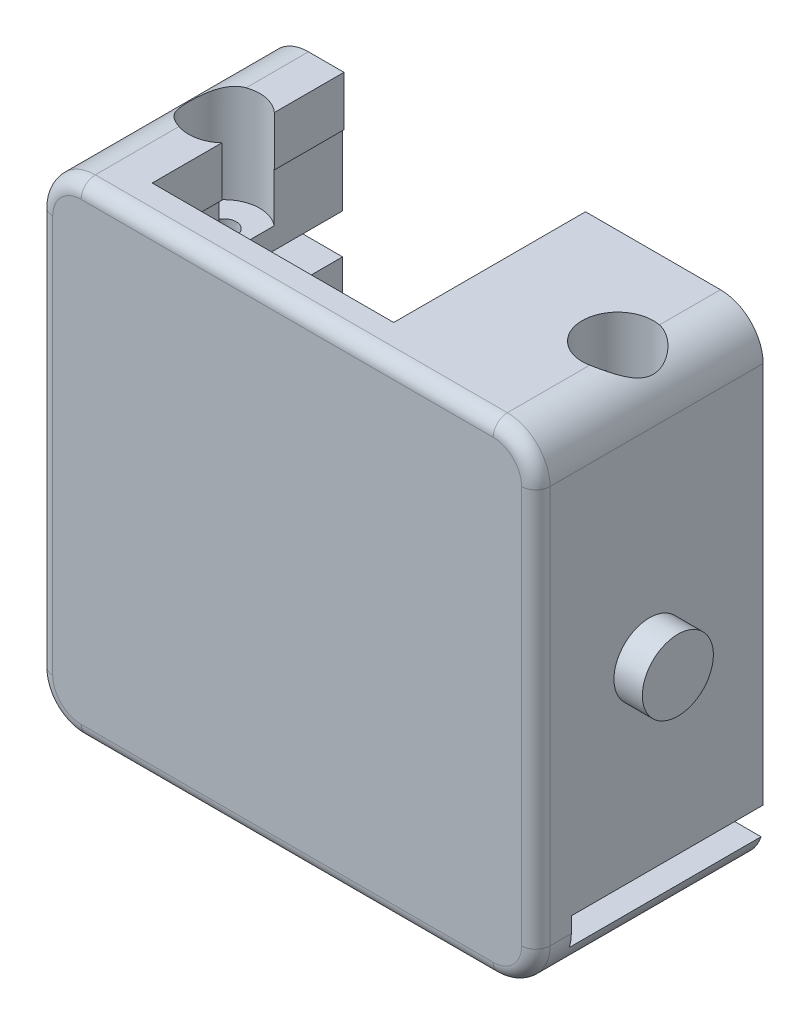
ISO-10303-21;
HEADER;
FILE_DESCRIPTION(('STEP AP214'),'2;1');
FILE_NAME('part.step','',(''),(''),'','','');
FILE_SCHEMA(('AUTOMOTIVE_DESIGN { 1 0 10303 214 1 1 1 1 }'));
ENDSEC;
DATA;
#1=APPLICATION_CONTEXT('core data for automotive mechanical design processes');
#2=APPLICATION_PROTOCOL_DEFINITION('international standard','automotive_design',2000,#1);
#3=PRODUCT_CONTEXT('',#1,'mechanical');
#4=PRODUCT('Part','Part','',(#3));
#5=PRODUCT_RELATED_PRODUCT_CATEGORY('part','',(#4));
#6=PRODUCT_DEFINITION_FORMATION('','',#4);
#7=PRODUCT_DEFINITION_CONTEXT('part definition',#1,'design');
#8=PRODUCT_DEFINITION('design','',#6,#7);
#9=PRODUCT_DEFINITION_SHAPE('','',#8);
#10=(LENGTH_UNIT() NAMED_UNIT(*) SI_UNIT(.MILLI.,.METRE.));
#11=(NAMED_UNIT(*) PLANE_ANGLE_UNIT() SI_UNIT($,.RADIAN.));
#12=(NAMED_UNIT(*) SI_UNIT($,.STERADIAN.) SOLID_ANGLE_UNIT());
#13=UNCERTAINTY_MEASURE_WITH_UNIT(LENGTH_MEASURE(1.E-05),#10,'distance_accuracy_value','');
#14=(GEOMETRIC_REPRESENTATION_CONTEXT(3) GLOBAL_UNCERTAINTY_ASSIGNED_CONTEXT((#13)) GLOBAL_UNIT_ASSIGNED_CONTEXT((#10,
#11,#12)) REPRESENTATION_CONTEXT('',''));
#15=CARTESIAN_POINT('',(0.,0.,0.));
#16=DIRECTION('',(0.,0.,1.));
#17=DIRECTION('',(1.,0.,0.));
#18=AXIS2_PLACEMENT_3D('',#15,#16,#17);
#19=CARTESIAN_POINT('',(-12.,22.,-24.2857917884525));
#20=DIRECTION('',(-1.,0.,0.));
#21=DIRECTION('',(0.,0.,1.));
#22=AXIS2_PLACEMENT_3D('',#19,#20,#21);
#23=PLANE('',#22);
#24=DIRECTION('',(0.,0.,1.));
#25=VECTOR('',#24,1.);
#26=CARTESIAN_POINT('',(-12.,23.5,-24.2857917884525));
#27=LINE('',#26,#25);
#28=CARTESIAN_POINT('',(-12.,23.5,-15.6873572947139));
#29=VERTEX_POINT('',#28);
#30=CARTESIAN_POINT('',(-12.,23.5,-10.7857917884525));
#31=VERTEX_POINT('',#30);
#32=EDGE_CURVE('E647',#29,#31,#27,.T.);
#33=ORIENTED_EDGE('',*,*,#32,.F.);
#34=DIRECTION('',(0.,1.,0.));
#35=VECTOR('',#34,1.);
#36=CARTESIAN_POINT('',(-12.,20.,-15.6873572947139));
#37=LINE('',#36,#35);
#38=CARTESIAN_POINT('',(-12.,27.,-15.6873572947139));
#39=VERTEX_POINT('',#38);
#40=EDGE_CURVE('E442',#29,#39,#37,.T.);
#41=ORIENTED_EDGE('',*,*,#40,.T.);
#42=DIRECTION('',(0.,0.,1.));
#43=VECTOR('',#42,1.);
#44=CARTESIAN_POINT('',(-12.,27.,-24.2857917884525));
#45=LINE('',#44,#43);
#46=CARTESIAN_POINT('',(-12.,27.,-10.7857917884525));
#47=VERTEX_POINT('',#46);
#48=EDGE_CURVE('E651',#39,#47,#45,.T.);
#49=ORIENTED_EDGE('',*,*,#48,.T.);
#50=DIRECTION('',(0.,1.,0.));
#51=VECTOR('',#50,1.);
#52=CARTESIAN_POINT('',(-12.,22.,-10.7857917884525));
#53=LINE('',#52,#51);
#54=EDGE_CURVE('E661',#31,#47,#53,.T.);
#55=ORIENTED_EDGE('',*,*,#54,.F.);
#56=EDGE_LOOP('',(#33,#41,#49,#55));
#57=FACE_BOUND('',#56,.T.);
#58=ADVANCED_FACE('F35',(#57),#23,.F.);
#59=CARTESIAN_POINT('',(-17.5,27.,-24.2857917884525));
#60=DIRECTION('',(0.,1.,0.));
#61=DIRECTION('',(0.,0.,1.));
#62=AXIS2_PLACEMENT_3D('',#59,#60,#61);
#63=PLANE('',#62);
#64=CARTESIAN_POINT('',(-13.6832379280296,27.,-17.5357917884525));
#65=DIRECTION('',(0.,1.,0.));
#66=DIRECTION('',(0.,0.,1.));
#67=AXIS2_PLACEMENT_3D('',#64,#65,#66);
#68=CIRCLE('',#67,2.5);
#69=CARTESIAN_POINT('',(-12.,27.,-19.3842262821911));
#70=VERTEX_POINT('',#69);
#71=CARTESIAN_POINT('',(-14.5,27.,-19.8986078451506));
#72=VERTEX_POINT('',#71);
#73=EDGE_CURVE('E437',#70,#72,#68,.T.);
#74=ORIENTED_EDGE('',*,*,#73,.F.);
#75=CARTESIAN_POINT('',(-12.,27.,-24.2857917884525));
#76=VERTEX_POINT('',#75);
#77=EDGE_CURVE('E652',#76,#70,#45,.T.);
#78=ORIENTED_EDGE('',*,*,#77,.F.);
#79=DIRECTION('',(-1.,0.,0.));
#80=VECTOR('',#79,1.);
#81=CARTESIAN_POINT('',(-17.5,27.,-24.2857917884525));
#82=LINE('',#81,#80);
#83=CARTESIAN_POINT('',(-14.5,27.,-24.2857917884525));
#84=VERTEX_POINT('',#83);
#85=EDGE_CURVE('E679',#76,#84,#82,.T.);
#86=ORIENTED_EDGE('',*,*,#85,.T.);
#87=DIRECTION('',(0.,0.,1.));
#88=VECTOR('',#87,1.);
#89=CARTESIAN_POINT('',(-14.5,27.,-24.2857917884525));
#90=LINE('',#89,#88);
#91=EDGE_CURVE('E739',#84,#72,#90,.T.);
#92=ORIENTED_EDGE('',*,*,#91,.T.);
#93=EDGE_LOOP('',(#74,#78,#86,#92));
#94=FACE_BOUND('',#93,.T.);
#95=ADVANCED_FACE('F926',(#94),#63,.T.);
#96=CARTESIAN_POINT('',(11.9,23.5,-65.4930811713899));
#97=DIRECTION('',(0.,-1.,0.));
#98=DIRECTION('',(0.,0.,-1.));
#99=AXIS2_PLACEMENT_3D('',#96,#97,#98);
#100=PLANE('',#99);
#101=CARTESIAN_POINT('',(-13.6832379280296,23.5,-17.5357917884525));
#102=DIRECTION('',(0.,-1.,0.));
#103=DIRECTION('',(0.,0.,-1.));
#104=AXIS2_PLACEMENT_3D('',#101,#102,#103);
#105=CIRCLE('',#104,2.5);
#106=CARTESIAN_POINT('',(-12.1,23.5,-19.4705676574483));
#107=VERTEX_POINT('',#106);
#108=CARTESIAN_POINT('',(-12.,23.5,-19.3842262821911));
#109=VERTEX_POINT('',#108);
#110=EDGE_CURVE('E443',#107,#109,#105,.T.);
#111=ORIENTED_EDGE('',*,*,#110,.F.);
#112=DIRECTION('',(0.,0.,1.));
#113=VECTOR('',#112,1.);
#114=CARTESIAN_POINT('',(-12.1,23.5,-65.4930811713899));
#115=LINE('',#114,#113);
#116=CARTESIAN_POINT('',(-12.1,23.5,-24.2857917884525));
#117=VERTEX_POINT('',#116);
#118=EDGE_CURVE('E605',#117,#107,#115,.T.);
#119=ORIENTED_EDGE('',*,*,#118,.F.);
#120=DIRECTION('',(-1.,0.,0.));
#121=VECTOR('',#120,1.);
#122=CARTESIAN_POINT('',(11.9,23.5,-24.2857917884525));
#123=LINE('',#122,#121);
#124=CARTESIAN_POINT('',(-12.,23.5,-24.2857917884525));
#125=VERTEX_POINT('',#124);
#126=EDGE_CURVE('E643',#125,#117,#123,.T.);
#127=ORIENTED_EDGE('',*,*,#126,.F.);
#128=EDGE_CURVE('E648',#125,#109,#27,.T.);
#129=ORIENTED_EDGE('',*,*,#128,.T.);
#130=EDGE_LOOP('',(#111,#119,#127,#129));
#131=FACE_BOUND('',#130,.T.);
#132=ADVANCED_FACE('F829',(#131),#100,.T.);
#133=CARTESIAN_POINT('',(0.,0.,-24.2857917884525));
#134=DIRECTION('',(0.,0.,1.));
#135=DIRECTION('',(1.,0.,0.));
#136=AXIS2_PLACEMENT_3D('',#133,#134,#135);
#137=PLANE('',#136);
#138=DIRECTION('',(0.,-1.,0.));
#139=VECTOR('',#138,1.);
#140=CARTESIAN_POINT('',(-16.5,13.2,-24.2857917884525));
#141=LINE('',#140,#139);
#142=CARTESIAN_POINT('',(-16.5,13.2,-24.2857917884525));
#143=VERTEX_POINT('',#142);
#144=CARTESIAN_POINT('',(-16.5,-4.92054771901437,-24.2857917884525));
#145=VERTEX_POINT('',#144);
#146=EDGE_CURVE('E511',#143,#145,#141,.T.);
#147=ORIENTED_EDGE('',*,*,#146,.T.);
#148=DIRECTION('',(-1.,0.,0.));
#149=VECTOR('',#148,1.);
#150=CARTESIAN_POINT('',(25.3128510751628,-4.92054771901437,-24.2857917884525));
#151=LINE('',#150,#149);
#152=CARTESIAN_POINT('',(17.3552743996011,-4.92054771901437,-24.2857917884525));
#153=VERTEX_POINT('',#152);
#154=EDGE_CURVE('E470',#153,#145,#151,.T.);
#155=ORIENTED_EDGE('',*,*,#154,.F.);
#156=CARTESIAN_POINT('',(14.5,-4.00000000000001,-24.2857917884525));
#157=DIRECTION('',(0.,0.,1.));
#158=DIRECTION('',(1.,0.,0.));
#159=AXIS2_PLACEMENT_3D('',#156,#157,#158);
#160=CIRCLE('',#159,3.);
#161=CARTESIAN_POINT('',(14.5,-7.00000000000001,-24.2857917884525));
#162=VERTEX_POINT('',#161);
#163=EDGE_CURVE('E746',#153,#162,#160,.F.);
#164=ORIENTED_EDGE('',*,*,#163,.T.);
#165=DIRECTION('',(1.,0.,0.));
#166=VECTOR('',#165,1.);
#167=CARTESIAN_POINT('',(-17.5,-7.00000000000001,-24.2857917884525));
#168=LINE('',#167,#166);
#169=CARTESIAN_POINT('',(-14.5,-7.00000000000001,-24.2857917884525));
#170=VERTEX_POINT('',#169);
#171=EDGE_CURVE('E674',#170,#162,#168,.T.);
#172=ORIENTED_EDGE('',*,*,#171,.F.);
#173=CARTESIAN_POINT('',(-14.5,-4.00000000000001,-24.2857917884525));
#174=DIRECTION('',(0.,0.,1.));
#175=DIRECTION('',(1.,0.,0.));
#176=AXIS2_PLACEMENT_3D('',#173,#174,#175);
#177=CIRCLE('',#176,3.);
#178=CARTESIAN_POINT('',(-17.5,-4.00000000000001,-24.2857917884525));
#179=VERTEX_POINT('',#178);
#180=EDGE_CURVE('E748',#170,#179,#177,.F.);
#181=ORIENTED_EDGE('',*,*,#180,.T.);
#182=DIRECTION('',(0.,-1.,0.));
#183=VECTOR('',#182,1.);
#184=CARTESIAN_POINT('',(-17.5,27.,-24.2857917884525));
#185=LINE('',#184,#183);
#186=CARTESIAN_POINT('',(-17.5,24.,-24.2857917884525));
#187=VERTEX_POINT('',#186);
#188=EDGE_CURVE('E664',#187,#179,#185,.T.);
#189=ORIENTED_EDGE('',*,*,#188,.F.);
#190=CARTESIAN_POINT('',(-14.5,24.,-24.2857917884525));
#191=DIRECTION('',(0.,0.,1.));
#192=DIRECTION('',(1.,0.,0.));
#193=AXIS2_PLACEMENT_3D('',#190,#191,#192);
#194=CIRCLE('',#193,3.);
#195=EDGE_CURVE('E753',#187,#84,#194,.F.);
#196=ORIENTED_EDGE('',*,*,#195,.T.);
#197=ORIENTED_EDGE('',*,*,#85,.F.);
#198=DIRECTION('',(0.,1.,0.));
#199=VECTOR('',#198,1.);
#200=CARTESIAN_POINT('',(-12.,22.,-24.2857917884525));
#201=LINE('',#200,#199);
#202=EDGE_CURVE('E662',#125,#76,#201,.T.);
#203=ORIENTED_EDGE('',*,*,#202,.F.);
#204=ORIENTED_EDGE('',*,*,#126,.T.);
#205=DIRECTION('',(0.,-1.,0.));
#206=VECTOR('',#205,1.);
#207=CARTESIAN_POINT('',(-12.1,23.5,-24.2857917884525));
#208=LINE('',#207,#206);
#209=CARTESIAN_POINT('',(-12.1,18.5,-24.2857917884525));
#210=VERTEX_POINT('',#209);
#211=EDGE_CURVE('E492',#117,#210,#208,.T.);
#212=ORIENTED_EDGE('',*,*,#211,.T.);
#213=DIRECTION('',(-1.,0.,0.));
#214=VECTOR('',#213,1.);
#215=CARTESIAN_POINT('',(-12.1,18.5,-24.2857917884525));
#216=LINE('',#215,#214);
#217=CARTESIAN_POINT('',(-16.5,18.5,-24.2857917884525));
#218=VERTEX_POINT('',#217);
#219=EDGE_CURVE('E495',#210,#218,#216,.T.);
#220=ORIENTED_EDGE('',*,*,#219,.T.);
#221=DIRECTION('',(0.,-1.,0.));
#222=VECTOR('',#221,1.);
#223=CARTESIAN_POINT('',(-16.5,18.5,-24.2857917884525));
#224=LINE('',#223,#222);
#225=CARTESIAN_POINT('',(-16.5,15.7,-24.2857917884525));
#226=VERTEX_POINT('',#225);
#227=EDGE_CURVE('E499',#218,#226,#224,.T.);
#228=ORIENTED_EDGE('',*,*,#227,.T.);
#229=DIRECTION('',(1.,0.,0.));
#230=VECTOR('',#229,1.);
#231=CARTESIAN_POINT('',(-16.5,15.7,-24.2857917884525));
#232=LINE('',#231,#230);
#233=CARTESIAN_POINT('',(-12.1,15.7,-24.2857917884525));
#234=VERTEX_POINT('',#233);
#235=EDGE_CURVE('E502',#226,#234,#232,.T.);
#236=ORIENTED_EDGE('',*,*,#235,.T.);
#237=DIRECTION('',(0.,-1.,0.));
#238=VECTOR('',#237,1.);
#239=CARTESIAN_POINT('',(-12.1,15.7,-24.2857917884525));
#240=LINE('',#239,#238);
#241=CARTESIAN_POINT('',(-12.1,13.2,-24.2857917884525));
#242=VERTEX_POINT('',#241);
#243=EDGE_CURVE('E505',#234,#242,#240,.T.);
#244=ORIENTED_EDGE('',*,*,#243,.T.);
#245=DIRECTION('',(-1.,0.,0.));
#246=VECTOR('',#245,1.);
#247=CARTESIAN_POINT('',(-12.1,13.2,-24.2857917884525));
#248=LINE('',#247,#246);
#249=EDGE_CURVE('E508',#242,#143,#248,.T.);
#250=ORIENTED_EDGE('',*,*,#249,.T.);
#251=EDGE_LOOP('',(#147,#155,#164,#172,#181,#189,#196,#197,#203,#204,#212,#220,#228,#236,#244,#250));
#252=FACE_BOUND('',#251,.T.);
#253=ADVANCED_FACE('F917',(#252),#137,.F.);
#254=CARTESIAN_POINT('',(0.,0.,-8.2857917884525));
#255=DIRECTION('',(0.,0.,1.));
#256=DIRECTION('',(1.,0.,0.));
#257=AXIS2_PLACEMENT_3D('',#254,#255,#256);
#258=PLANE('',#257);
#259=CARTESIAN_POINT('',(14.5,-4.00000000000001,-8.2857917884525));
#260=DIRECTION('',(0.,0.,1.));
#261=DIRECTION('',(1.,0.,0.));
#262=AXIS2_PLACEMENT_3D('',#259,#260,#261);
#263=CIRCLE('',#262,2.);
#264=CARTESIAN_POINT('',(16.5,-4.00000000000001,-8.2857917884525));
#265=VERTEX_POINT('',#264);
#266=CARTESIAN_POINT('',(14.5,-6.00000000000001,-8.2857917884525));
#267=VERTEX_POINT('',#266);
#268=EDGE_CURVE('E719',#265,#267,#263,.F.);
#269=ORIENTED_EDGE('',*,*,#268,.F.);
#270=DIRECTION('',(0.,1.,0.));
#271=VECTOR('',#270,1.);
#272=CARTESIAN_POINT('',(16.5,0.,-8.2857917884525));
#273=LINE('',#272,#271);
#274=CARTESIAN_POINT('',(16.5,24.,-8.2857917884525));
#275=VERTEX_POINT('',#274);
#276=EDGE_CURVE('E691',#265,#275,#273,.T.);
#277=ORIENTED_EDGE('',*,*,#276,.T.);
#278=CARTESIAN_POINT('',(14.5,24.,-8.2857917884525));
#279=DIRECTION('',(0.,0.,1.));
#280=DIRECTION('',(1.,0.,0.));
#281=AXIS2_PLACEMENT_3D('',#278,#279,#280);
#282=CIRCLE('',#281,2.);
#283=CARTESIAN_POINT('',(14.5,26.,-8.2857917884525));
#284=VERTEX_POINT('',#283);
#285=EDGE_CURVE('E714',#284,#275,#282,.F.);
#286=ORIENTED_EDGE('',*,*,#285,.F.);
#287=DIRECTION('',(-1.,0.,0.));
#288=VECTOR('',#287,1.);
#289=CARTESIAN_POINT('',(0.,26.,-8.2857917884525));
#290=LINE('',#289,#288);
#291=CARTESIAN_POINT('',(-14.5,26.,-8.2857917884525));
#292=VERTEX_POINT('',#291);
#293=EDGE_CURVE('E682',#284,#292,#290,.T.);
#294=ORIENTED_EDGE('',*,*,#293,.T.);
#295=CARTESIAN_POINT('',(-14.5,24.,-8.2857917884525));
#296=DIRECTION('',(0.,0.,1.));
#297=DIRECTION('',(1.,0.,0.));
#298=AXIS2_PLACEMENT_3D('',#295,#296,#297);
#299=CIRCLE('',#298,2.);
#300=CARTESIAN_POINT('',(-16.5,24.,-8.2857917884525));
#301=VERTEX_POINT('',#300);
#302=EDGE_CURVE('E711',#301,#292,#299,.F.);
#303=ORIENTED_EDGE('',*,*,#302,.F.);
#304=DIRECTION('',(0.,-1.,0.));
#305=VECTOR('',#304,1.);
#306=CARTESIAN_POINT('',(-16.5,0.,-8.2857917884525));
#307=LINE('',#306,#305);
#308=CARTESIAN_POINT('',(-16.5,-4.00000000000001,-8.2857917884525));
#309=VERTEX_POINT('',#308);
#310=EDGE_CURVE('E685',#301,#309,#307,.T.);
#311=ORIENTED_EDGE('',*,*,#310,.T.);
#312=CARTESIAN_POINT('',(-14.5,-4.00000000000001,-8.2857917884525));
#313=DIRECTION('',(0.,0.,1.));
#314=DIRECTION('',(1.,0.,0.));
#315=AXIS2_PLACEMENT_3D('',#312,#313,#314);
#316=CIRCLE('',#315,2.);
#317=CARTESIAN_POINT('',(-14.5,-6.00000000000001,-8.2857917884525));
#318=VERTEX_POINT('',#317);
#319=EDGE_CURVE('E717',#318,#309,#316,.F.);
#320=ORIENTED_EDGE('',*,*,#319,.F.);
#321=DIRECTION('',(1.,0.,0.));
#322=VECTOR('',#321,1.);
#323=CARTESIAN_POINT('',(0.,-6.00000000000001,-8.2857917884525));
#324=LINE('',#323,#322);
#325=EDGE_CURVE('E688',#318,#267,#324,.T.);
#326=ORIENTED_EDGE('',*,*,#325,.T.);
#327=EDGE_LOOP('',(#269,#277,#286,#294,#303,#311,#320,#326));
#328=FACE_BOUND('',#327,.T.);
#329=ADVANCED_FACE('F915',(#328),#258,.T.);
#330=DIRECTION('',(1.,0.,0.));
#331=VECTOR('',#330,1.);
#332=CARTESIAN_POINT('',(11.9,-2.92054771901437,-24.2857917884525));
#333=LINE('',#332,#331);
#334=CARTESIAN_POINT('',(-12.1,-2.92054771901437,-24.2857917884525));
#335=VERTEX_POINT('',#334);
#336=CARTESIAN_POINT('',(17.5,-2.92054771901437,-24.2857917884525));
#337=VERTEX_POINT('',#336);
#338=EDGE_CURVE('E468',#335,#337,#333,.T.);
#339=ORIENTED_EDGE('',*,*,#338,.F.);
#340=DIRECTION('',(0.,-1.,0.));
#341=VECTOR('',#340,1.);
#342=CARTESIAN_POINT('',(-12.1,-2.92054771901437,-24.2857917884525));
#343=LINE('',#342,#341);
#344=CARTESIAN_POINT('',(-12.1,-1.17874993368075,-24.2857917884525));
#345=VERTEX_POINT('',#344);
#346=EDGE_CURVE('E471',#345,#335,#343,.T.);
#347=ORIENTED_EDGE('',*,*,#346,.F.);
#348=DIRECTION('',(1.,0.,0.));
#349=VECTOR('',#348,1.);
#350=CARTESIAN_POINT('',(11.9,-1.17874993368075,-24.2857917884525));
#351=LINE('',#350,#349);
#352=CARTESIAN_POINT('',(11.9,-1.17874993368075,-24.2857917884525));
#353=VERTEX_POINT('',#352);
#354=EDGE_CURVE('E513',#345,#353,#351,.T.);
#355=ORIENTED_EDGE('',*,*,#354,.T.);
#356=DIRECTION('',(0.,1.,0.));
#357=VECTOR('',#356,1.);
#358=CARTESIAN_POINT('',(11.9,4.5,-24.2857917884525));
#359=LINE('',#358,#357);
#360=CARTESIAN_POINT('',(11.9,4.5,-24.2857917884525));
#361=VERTEX_POINT('',#360);
#362=EDGE_CURVE('E516',#353,#361,#359,.T.);
#363=ORIENTED_EDGE('',*,*,#362,.T.);
#364=DIRECTION('',(1.,0.,0.));
#365=VECTOR('',#364,1.);
#366=CARTESIAN_POINT('',(16.5,4.5,-24.2857917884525));
#367=LINE('',#366,#365);
#368=CARTESIAN_POINT('',(16.5,4.5,-24.2857917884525));
#369=VERTEX_POINT('',#368);
#370=EDGE_CURVE('E519',#361,#369,#367,.T.);
#371=ORIENTED_EDGE('',*,*,#370,.T.);
#372=DIRECTION('',(0.,1.,0.));
#373=VECTOR('',#372,1.);
#374=CARTESIAN_POINT('',(16.5,13.2,-24.2857917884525));
#375=LINE('',#374,#373);
#376=CARTESIAN_POINT('',(16.5,13.2,-24.2857917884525));
#377=VERTEX_POINT('',#376);
#378=EDGE_CURVE('E522',#369,#377,#375,.T.);
#379=ORIENTED_EDGE('',*,*,#378,.T.);
#380=DIRECTION('',(-1.,0.,0.));
#381=VECTOR('',#380,1.);
#382=CARTESIAN_POINT('',(11.9,13.2,-24.2857917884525));
#383=LINE('',#382,#381);
#384=CARTESIAN_POINT('',(11.9,13.2,-24.2857917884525));
#385=VERTEX_POINT('',#384);
#386=EDGE_CURVE('E525',#377,#385,#383,.T.);
#387=ORIENTED_EDGE('',*,*,#386,.T.);
#388=DIRECTION('',(0.,1.,0.));
#389=VECTOR('',#388,1.);
#390=CARTESIAN_POINT('',(11.9,15.7,-24.2857917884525));
#391=LINE('',#390,#389);
#392=CARTESIAN_POINT('',(11.9,15.7,-24.2857917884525));
#393=VERTEX_POINT('',#392);
#394=EDGE_CURVE('E528',#385,#393,#391,.T.);
#395=ORIENTED_EDGE('',*,*,#394,.T.);
#396=DIRECTION('',(1.,0.,0.));
#397=VECTOR('',#396,1.);
#398=CARTESIAN_POINT('',(16.5,15.7,-24.2857917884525));
#399=LINE('',#398,#397);
#400=CARTESIAN_POINT('',(16.5,15.7,-24.2857917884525));
#401=VERTEX_POINT('',#400);
#402=EDGE_CURVE('E531',#393,#401,#399,.T.);
#403=ORIENTED_EDGE('',*,*,#402,.T.);
#404=DIRECTION('',(0.,1.,0.));
#405=VECTOR('',#404,1.);
#406=CARTESIAN_POINT('',(16.5,18.5,-24.2857917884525));
#407=LINE('',#406,#405);
#408=CARTESIAN_POINT('',(16.5,18.5,-24.2857917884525));
#409=VERTEX_POINT('',#408);
#410=EDGE_CURVE('E534',#401,#409,#407,.T.);
#411=ORIENTED_EDGE('',*,*,#410,.T.);
#412=DIRECTION('',(-1.,0.,0.));
#413=VECTOR('',#412,1.);
#414=CARTESIAN_POINT('',(16.5,18.5,-24.2857917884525));
#415=LINE('',#414,#413);
#416=CARTESIAN_POINT('',(11.9,18.5,-24.2857917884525));
#417=VERTEX_POINT('',#416);
#418=EDGE_CURVE('E537',#409,#417,#415,.T.);
#419=ORIENTED_EDGE('',*,*,#418,.T.);
#420=DIRECTION('',(0.,1.,0.));
#421=VECTOR('',#420,1.);
#422=CARTESIAN_POINT('',(11.9,23.5,-24.2857917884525));
#423=LINE('',#422,#421);
#424=CARTESIAN_POINT('',(11.9,23.5,-24.2857917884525));
#425=VERTEX_POINT('',#424);
#426=EDGE_CURVE('E540',#417,#425,#423,.T.);
#427=ORIENTED_EDGE('',*,*,#426,.T.);
#428=CARTESIAN_POINT('',(5.,23.5,-24.2857917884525));
#429=VERTEX_POINT('',#428);
#430=EDGE_CURVE('E496',#425,#429,#123,.T.);
#431=ORIENTED_EDGE('',*,*,#430,.T.);
#432=DIRECTION('',(0.,1.,0.));
#433=VECTOR('',#432,1.);
#434=CARTESIAN_POINT('',(5.,22.,-24.2857917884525));
#435=LINE('',#434,#433);
#436=CARTESIAN_POINT('',(5.,27.,-24.2857917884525));
#437=VERTEX_POINT('',#436);
#438=EDGE_CURVE('E665',#429,#437,#435,.T.);
#439=ORIENTED_EDGE('',*,*,#438,.T.);
#440=CARTESIAN_POINT('',(14.5,27.,-24.2857917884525));
#441=VERTEX_POINT('',#440);
#442=EDGE_CURVE('E680',#441,#437,#82,.T.);
#443=ORIENTED_EDGE('',*,*,#442,.F.);
#444=CARTESIAN_POINT('',(14.5,24.,-24.2857917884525));
#445=DIRECTION('',(0.,0.,1.));
#446=DIRECTION('',(1.,0.,0.));
#447=AXIS2_PLACEMENT_3D('',#444,#445,#446);
#448=CIRCLE('',#447,3.);
#449=CARTESIAN_POINT('',(17.5,24.,-24.2857917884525));
#450=VERTEX_POINT('',#449);
#451=EDGE_CURVE('E750',#441,#450,#448,.F.);
#452=ORIENTED_EDGE('',*,*,#451,.T.);
#453=DIRECTION('',(0.,1.,0.));
#454=VECTOR('',#453,1.);
#455=CARTESIAN_POINT('',(17.5,27.,-24.2857917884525));
#456=LINE('',#455,#454);
#457=EDGE_CURVE('E677',#337,#450,#456,.T.);
#458=ORIENTED_EDGE('',*,*,#457,.F.);
#459=EDGE_LOOP('',(#339,#347,#355,#363,#371,#379,#387,#395,#403,#411,#419,#427,#431,#439,#443,
#452,#458));
#460=FACE_BOUND('',#459,.T.);
#461=ADVANCED_FACE('F911',(#460),#137,.F.);
#462=ORIENTED_EDGE('',*,*,#77,.T.);
#463=DIRECTION('',(0.,1.,0.));
#464=VECTOR('',#463,1.);
#465=CARTESIAN_POINT('',(-12.,20.,-19.3842262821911));
#466=LINE('',#465,#464);
#467=EDGE_CURVE('E448',#70,#109,#466,.F.);
#468=ORIENTED_EDGE('',*,*,#467,.T.);
#469=ORIENTED_EDGE('',*,*,#128,.F.);
#470=ORIENTED_EDGE('',*,*,#202,.T.);
#471=EDGE_LOOP('',(#462,#468,#469,#470));
#472=FACE_BOUND('',#471,.T.);
#473=ADVANCED_FACE('F903',(#472),#23,.F.);
#474=CARTESIAN_POINT('',(5.,22.,-24.2857917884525));
#475=DIRECTION('',(1.,0.,0.));
#476=DIRECTION('',(0.,0.,-1.));
#477=AXIS2_PLACEMENT_3D('',#474,#475,#476);
#478=PLANE('',#477);
#479=DIRECTION('',(0.,0.,-1.));
#480=VECTOR('',#479,1.);
#481=CARTESIAN_POINT('',(5.,23.5,-24.2857917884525));
#482=LINE('',#481,#480);
#483=CARTESIAN_POINT('',(5.,23.5,-10.7857917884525));
#484=VERTEX_POINT('',#483);
#485=EDGE_CURVE('E543',#484,#429,#482,.T.);
#486=ORIENTED_EDGE('',*,*,#485,.F.);
#487=DIRECTION('',(0.,1.,0.));
#488=VECTOR('',#487,1.);
#489=CARTESIAN_POINT('',(5.,22.,-10.7857917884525));
#490=LINE('',#489,#488);
#491=CARTESIAN_POINT('',(5.,27.,-10.7857917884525));
#492=VERTEX_POINT('',#491);
#493=EDGE_CURVE('E668',#484,#492,#490,.T.);
#494=ORIENTED_EDGE('',*,*,#493,.T.);
#495=DIRECTION('',(0.,0.,-1.));
#496=VECTOR('',#495,1.);
#497=CARTESIAN_POINT('',(5.,27.,-24.2857917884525));
#498=LINE('',#497,#496);
#499=EDGE_CURVE('E658',#492,#437,#498,.T.);
#500=ORIENTED_EDGE('',*,*,#499,.T.);
#501=ORIENTED_EDGE('',*,*,#438,.F.);
#502=EDGE_LOOP('',(#486,#494,#500,#501));
#503=FACE_BOUND('',#502,.T.);
#504=ADVANCED_FACE('F899',(#503),#478,.F.);
#505=CARTESIAN_POINT('',(-17.5,27.,-24.2857917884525));
#506=DIRECTION('',(-1.,0.,0.));
#507=DIRECTION('',(0.,-1.,0.));
#508=AXIS2_PLACEMENT_3D('',#505,#506,#507);
#509=PLANE('',#508);
#510=DIRECTION('',(0.,0.707106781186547,-0.707106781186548));
#511=VECTOR('',#510,1.);
#512=CARTESIAN_POINT('',(-17.5,9.99999999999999,-12.0431511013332));
#513=LINE('',#512,#511);
#514=CARTESIAN_POINT('',(-17.5,9.99999999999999,-12.0431511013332));
#515=VERTEX_POINT('',#514);
#516=CARTESIAN_POINT('',(-17.5,14.2426406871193,-16.2857917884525));
#517=VERTEX_POINT('',#516);
#518=EDGE_CURVE('E51',#515,#517,#513,.T.);
#519=ORIENTED_EDGE('',*,*,#518,.F.);
#520=DIRECTION('',(0.,0.707106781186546,0.707106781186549));
#521=VECTOR('',#520,1.);
#522=CARTESIAN_POINT('',(-17.5,9.99999999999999,-12.0431511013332));
#523=LINE('',#522,#521);
#524=CARTESIAN_POINT('',(-17.5,5.75735931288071,-16.2857917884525));
#525=VERTEX_POINT('',#524);
#526=EDGE_CURVE('E371',#525,#515,#523,.T.);
#527=ORIENTED_EDGE('',*,*,#526,.F.);
#528=DIRECTION('',(0.,-0.707106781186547,0.707106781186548));
#529=VECTOR('',#528,1.);
#530=CARTESIAN_POINT('',(-17.5,9.99999999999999,-20.5284324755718));
#531=LINE('',#530,#529);
#532=CARTESIAN_POINT('',(-17.5,9.99999999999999,-20.5284324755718));
#533=VERTEX_POINT('',#532);
#534=EDGE_CURVE('E385',#533,#525,#531,.T.);
#535=ORIENTED_EDGE('',*,*,#534,.F.);
#536=DIRECTION('',(0.,-0.707106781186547,-0.707106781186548));
#537=VECTOR('',#536,1.);
#538=CARTESIAN_POINT('',(-17.5,9.99999999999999,-20.5284324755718));
#539=LINE('',#538,#537);
#540=EDGE_CURVE('E383',#517,#533,#539,.T.);
#541=ORIENTED_EDGE('',*,*,#540,.F.);
#542=EDGE_LOOP('',(#519,#527,#535,#541));
#543=FACE_BOUND('',#542,.T.);
#544=DIRECTION('',(0.,-1.,0.));
#545=VECTOR('',#544,1.);
#546=CARTESIAN_POINT('',(-17.5,27.,-9.2857917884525));
#547=LINE('',#546,#545);
#548=CARTESIAN_POINT('',(-17.5,-4.00000000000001,-9.2857917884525));
#549=VERTEX_POINT('',#548);
#550=CARTESIAN_POINT('',(-17.5,24.,-9.2857917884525));
#551=VERTEX_POINT('',#550);
#552=EDGE_CURVE('E700',#549,#551,#547,.F.);
#553=ORIENTED_EDGE('',*,*,#552,.T.);
#554=DIRECTION('',(0.,0.,1.));
#555=VECTOR('',#554,1.);
#556=CARTESIAN_POINT('',(-17.5,24.,-24.2857917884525));
#557=LINE('',#556,#555);
#558=EDGE_CURVE('E744',#551,#187,#557,.F.);
#559=ORIENTED_EDGE('',*,*,#558,.T.);
#560=ORIENTED_EDGE('',*,*,#188,.T.);
#561=DIRECTION('',(0.,0.,1.));
#562=VECTOR('',#561,1.);
#563=CARTESIAN_POINT('',(-17.5,-4.00000000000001,-24.2857917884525));
#564=LINE('',#563,#562);
#565=EDGE_CURVE('E742',#179,#549,#564,.T.);
#566=ORIENTED_EDGE('',*,*,#565,.T.);
#567=EDGE_LOOP('',(#553,#559,#560,#566));
#568=FACE_BOUND('',#567,.T.);
#569=ADVANCED_FACE('F902',(#543,#568),#509,.T.);
#570=CARTESIAN_POINT('',(14.0167620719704,27.,-17.5357917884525));
#571=DIRECTION('',(0.,1.,0.));
#572=DIRECTION('',(0.,0.,1.));
#573=AXIS2_PLACEMENT_3D('',#570,#571,#572);
#574=CIRCLE('',#573,2.5);
#575=CARTESIAN_POINT('',(14.5,27.,-19.9886434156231));
#576=VERTEX_POINT('',#575);
#577=CARTESIAN_POINT('',(14.5,27.,-15.0829401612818));
#578=VERTEX_POINT('',#577);
#579=EDGE_CURVE('E432',#576,#578,#574,.T.);
#580=ORIENTED_EDGE('',*,*,#579,.F.);
#581=DIRECTION('',(0.,0.,1.));
#582=VECTOR('',#581,1.);
#583=CARTESIAN_POINT('',(14.5,27.,-24.2857917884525));
#584=LINE('',#583,#582);
#585=EDGE_CURVE('E734',#576,#441,#584,.F.);
#586=ORIENTED_EDGE('',*,*,#585,.T.);
#587=ORIENTED_EDGE('',*,*,#442,.T.);
#588=ORIENTED_EDGE('',*,*,#499,.F.);
#589=DIRECTION('',(1.,0.,0.));
#590=VECTOR('',#589,1.);
#591=CARTESIAN_POINT('',(-12.,27.,-10.7857917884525));
#592=LINE('',#591,#590);
#593=EDGE_CURVE('E655',#47,#492,#592,.T.);
#594=ORIENTED_EDGE('',*,*,#593,.F.);
#595=ORIENTED_EDGE('',*,*,#48,.F.);
#596=CARTESIAN_POINT('',(-14.5,27.,-15.1729757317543));
#597=VERTEX_POINT('',#596);
#598=EDGE_CURVE('E428',#597,#39,#68,.T.);
#599=ORIENTED_EDGE('',*,*,#598,.F.);
#600=CARTESIAN_POINT('',(-14.5,27.,-9.2857917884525));
#601=VERTEX_POINT('',#600);
#602=EDGE_CURVE('E738',#597,#601,#90,.T.);
#603=ORIENTED_EDGE('',*,*,#602,.T.);
#604=DIRECTION('',(-1.,0.,0.));
#605=VECTOR('',#604,1.);
#606=CARTESIAN_POINT('',(-17.5,27.,-9.2857917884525));
#607=LINE('',#606,#605);
#608=CARTESIAN_POINT('',(14.5,27.,-9.2857917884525));
#609=VERTEX_POINT('',#608);
#610=EDGE_CURVE('E703',#601,#609,#607,.F.);
#611=ORIENTED_EDGE('',*,*,#610,.T.);
#612=EDGE_CURVE('E735',#609,#578,#584,.F.);
#613=ORIENTED_EDGE('',*,*,#612,.T.);
#614=EDGE_LOOP('',(#580,#586,#587,#588,#594,#595,#599,#603,#611,#613));
#615=FACE_BOUND('',#614,.T.);
#616=ADVANCED_FACE('F921',(#615),#63,.T.);
#617=CARTESIAN_POINT('',(17.5,27.,-24.2857917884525));
#618=DIRECTION('',(1.,0.,0.));
#619=DIRECTION('',(0.,1.,0.));
#620=AXIS2_PLACEMENT_3D('',#617,#618,#619);
#621=PLANE('',#620);
#622=CARTESIAN_POINT('',(17.5,9.99999999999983,-16.2857917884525));
#623=DIRECTION('',(1.,0.,0.));
#624=DIRECTION('',(0.,1.,0.));
#625=AXIS2_PLACEMENT_3D('',#622,#623,#624);
#626=CIRCLE('',#625,2.5);
#627=CARTESIAN_POINT('',(17.5,12.4999999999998,-16.2857917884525));
#628=VERTEX_POINT('',#627);
#629=EDGE_CURVE('E398',#628,#628,#626,.T.);
#630=ORIENTED_EDGE('',*,*,#629,.F.);
#631=EDGE_LOOP('',(#630));
#632=FACE_BOUND('',#631,.T.);
#633=DIRECTION('',(0.,-1.,0.));
#634=VECTOR('',#633,1.);
#635=CARTESIAN_POINT('',(17.5,27.,-10.7857917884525));
#636=LINE('',#635,#634);
#637=CARTESIAN_POINT('',(17.5,-2.92054771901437,-10.7857917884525));
#638=VERTEX_POINT('',#637);
#639=CARTESIAN_POINT('',(17.5,-4.00000000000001,-10.7857917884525));
#640=VERTEX_POINT('',#639);
#641=EDGE_CURVE('E479',#638,#640,#636,.T.);
#642=ORIENTED_EDGE('',*,*,#641,.F.);
#643=DIRECTION('',(0.,0.,1.));
#644=VECTOR('',#643,1.);
#645=CARTESIAN_POINT('',(17.5,-2.92054771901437,-24.2857917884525));
#646=LINE('',#645,#644);
#647=EDGE_CURVE('E779',#337,#638,#646,.T.);
#648=ORIENTED_EDGE('',*,*,#647,.F.);
#649=ORIENTED_EDGE('',*,*,#457,.T.);
#650=DIRECTION('',(0.,0.,1.));
#651=VECTOR('',#650,1.);
#652=CARTESIAN_POINT('',(17.5,24.,-24.2857917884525));
#653=LINE('',#652,#651);
#654=CARTESIAN_POINT('',(17.5,24.,-9.2857917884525));
#655=VERTEX_POINT('',#654);
#656=EDGE_CURVE('E758',#450,#655,#653,.T.);
#657=ORIENTED_EDGE('',*,*,#656,.T.);
#658=DIRECTION('',(0.,1.,0.));
#659=VECTOR('',#658,1.);
#660=CARTESIAN_POINT('',(17.5,27.,-9.2857917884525));
#661=LINE('',#660,#659);
#662=CARTESIAN_POINT('',(17.5,-4.00000000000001,-9.2857917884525));
#663=VERTEX_POINT('',#662);
#664=EDGE_CURVE('E694',#655,#663,#661,.F.);
#665=ORIENTED_EDGE('',*,*,#664,.T.);
#666=DIRECTION('',(0.,0.,1.));
#667=VECTOR('',#666,1.);
#668=CARTESIAN_POINT('',(17.5,-4.00000000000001,-24.2857917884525));
#669=LINE('',#668,#667);
#670=EDGE_CURVE('E755',#663,#640,#669,.F.);
#671=ORIENTED_EDGE('',*,*,#670,.T.);
#672=EDGE_LOOP('',(#642,#648,#649,#657,#665,#671));
#673=FACE_BOUND('',#672,.T.);
#674=ADVANCED_FACE('F924',(#632,#673),#621,.T.);
#675=CARTESIAN_POINT('',(-17.5,-7.00000000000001,-24.2857917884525));
#676=DIRECTION('',(0.,-1.,0.));
#677=DIRECTION('',(0.,0.,-1.));
#678=AXIS2_PLACEMENT_3D('',#675,#676,#677);
#679=PLANE('',#678);
#680=CARTESIAN_POINT('',(-4.7410168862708,-7.00000000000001,-17.5357917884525));
#681=DIRECTION('',(0.,-1.,0.));
#682=DIRECTION('',(1.,0.,0.));
#683=AXIS2_PLACEMENT_3D('',#680,#681,#682);
#684=CIRCLE('',#683,3.);
#685=CARTESIAN_POINT('',(-1.7410168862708,-7.00000000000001,-17.5357917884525));
#686=VERTEX_POINT('',#685);
#687=EDGE_CURVE('E458',#686,#686,#684,.T.);
#688=ORIENTED_EDGE('',*,*,#687,.F.);
#689=EDGE_LOOP('',(#688));
#690=FACE_BOUND('',#689,.T.);
#691=DIRECTION('',(1.,0.,0.));
#692=VECTOR('',#691,1.);
#693=CARTESIAN_POINT('',(-17.5,-7.00000000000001,-9.2857917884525));
#694=LINE('',#693,#692);
#695=CARTESIAN_POINT('',(14.5,-7.00000000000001,-9.2857917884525));
#696=VERTEX_POINT('',#695);
#697=CARTESIAN_POINT('',(-14.5,-7.00000000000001,-9.2857917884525));
#698=VERTEX_POINT('',#697);
#699=EDGE_CURVE('E697',#696,#698,#694,.F.);
#700=ORIENTED_EDGE('',*,*,#699,.T.);
#701=DIRECTION('',(0.,0.,1.));
#702=VECTOR('',#701,1.);
#703=CARTESIAN_POINT('',(-14.5,-7.00000000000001,-24.2857917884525));
#704=LINE('',#703,#702);
#705=EDGE_CURVE('E762',#698,#170,#704,.F.);
#706=ORIENTED_EDGE('',*,*,#705,.T.);
#707=ORIENTED_EDGE('',*,*,#171,.T.);
#708=DIRECTION('',(0.,0.,1.));
#709=VECTOR('',#708,1.);
#710=CARTESIAN_POINT('',(14.5,-7.00000000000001,-24.2857917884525));
#711=LINE('',#710,#709);
#712=EDGE_CURVE('E760',#162,#696,#711,.T.);
#713=ORIENTED_EDGE('',*,*,#712,.T.);
#714=EDGE_LOOP('',(#700,#706,#707,#713));
#715=FACE_BOUND('',#714,.T.);
#716=ADVANCED_FACE('F907',(#690,#715),#679,.T.);
#717=CARTESIAN_POINT('',(-12.,22.,-10.7857917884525));
#718=DIRECTION('',(0.,0.,1.));
#719=DIRECTION('',(1.,0.,0.));
#720=AXIS2_PLACEMENT_3D('',#717,#718,#719);
#721=PLANE('',#720);
#722=DIRECTION('',(0.,1.,0.));
#723=VECTOR('',#722,1.);
#724=CARTESIAN_POINT('',(-16.5,13.2,-10.7857917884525));
#725=LINE('',#724,#723);
#726=CARTESIAN_POINT('',(-16.5,-4.92054771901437,-10.7857917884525));
#727=VERTEX_POINT('',#726);
#728=CARTESIAN_POINT('',(-16.5,13.2,-10.7857917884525));
#729=VERTEX_POINT('',#728);
#730=EDGE_CURVE('E575',#727,#729,#725,.T.);
#731=ORIENTED_EDGE('',*,*,#730,.T.);
#732=DIRECTION('',(1.,0.,0.));
#733=VECTOR('',#732,1.);
#734=CARTESIAN_POINT('',(-12.1,13.2,-10.7857917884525));
#735=LINE('',#734,#733);
#736=CARTESIAN_POINT('',(-12.1,13.2,-10.7857917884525));
#737=VERTEX_POINT('',#736);
#738=EDGE_CURVE('E578',#729,#737,#735,.T.);
#739=ORIENTED_EDGE('',*,*,#738,.T.);
#740=DIRECTION('',(0.,1.,0.));
#741=VECTOR('',#740,1.);
#742=CARTESIAN_POINT('',(-12.1,15.7,-10.7857917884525));
#743=LINE('',#742,#741);
#744=CARTESIAN_POINT('',(-12.1,15.7,-10.7857917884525));
#745=VERTEX_POINT('',#744);
#746=EDGE_CURVE('E581',#737,#745,#743,.T.);
#747=ORIENTED_EDGE('',*,*,#746,.T.);
#748=DIRECTION('',(-1.,0.,0.));
#749=VECTOR('',#748,1.);
#750=CARTESIAN_POINT('',(-16.5,15.7,-10.7857917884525));
#751=LINE('',#750,#749);
#752=CARTESIAN_POINT('',(-16.5,15.7,-10.7857917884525));
#753=VERTEX_POINT('',#752);
#754=EDGE_CURVE('E584',#745,#753,#751,.T.);
#755=ORIENTED_EDGE('',*,*,#754,.T.);
#756=DIRECTION('',(0.,1.,0.));
#757=VECTOR('',#756,1.);
#758=CARTESIAN_POINT('',(-16.5,18.5,-10.7857917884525));
#759=LINE('',#758,#757);
#760=CARTESIAN_POINT('',(-16.5,18.5,-10.7857917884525));
#761=VERTEX_POINT('',#760);
#762=EDGE_CURVE('E587',#753,#761,#759,.T.);
#763=ORIENTED_EDGE('',*,*,#762,.T.);
#764=DIRECTION('',(1.,0.,0.));
#765=VECTOR('',#764,1.);
#766=CARTESIAN_POINT('',(-12.1,18.5,-10.7857917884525));
#767=LINE('',#766,#765);
#768=CARTESIAN_POINT('',(-12.1,18.5,-10.7857917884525));
#769=VERTEX_POINT('',#768);
#770=EDGE_CURVE('E590',#761,#769,#767,.T.);
#771=ORIENTED_EDGE('',*,*,#770,.T.);
#772=DIRECTION('',(0.,1.,0.));
#773=VECTOR('',#772,1.);
#774=CARTESIAN_POINT('',(-12.1,23.5,-10.7857917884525));
#775=LINE('',#774,#773);
#776=CARTESIAN_POINT('',(-12.1,23.5,-10.7857917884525));
#777=VERTEX_POINT('',#776);
#778=EDGE_CURVE('E593',#769,#777,#775,.T.);
#779=ORIENTED_EDGE('',*,*,#778,.T.);
#780=DIRECTION('',(1.,0.,0.));
#781=VECTOR('',#780,1.);
#782=CARTESIAN_POINT('',(11.9,23.5,-10.7857917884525));
#783=LINE('',#782,#781);
#784=EDGE_CURVE('E597',#777,#31,#783,.T.);
#785=ORIENTED_EDGE('',*,*,#784,.T.);
#786=ORIENTED_EDGE('',*,*,#54,.T.);
#787=ORIENTED_EDGE('',*,*,#593,.T.);
#788=ORIENTED_EDGE('',*,*,#493,.F.);
#789=CARTESIAN_POINT('',(11.9,23.5,-10.7857917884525));
#790=VERTEX_POINT('',#789);
#791=EDGE_CURVE('E596',#484,#790,#783,.T.);
#792=ORIENTED_EDGE('',*,*,#791,.T.);
#793=DIRECTION('',(0.,-1.,0.));
#794=VECTOR('',#793,1.);
#795=CARTESIAN_POINT('',(11.9,23.5,-10.7857917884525));
#796=LINE('',#795,#794);
#797=CARTESIAN_POINT('',(11.9,18.5,-10.7857917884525));
#798=VERTEX_POINT('',#797);
#799=EDGE_CURVE('E544',#790,#798,#796,.T.);
#800=ORIENTED_EDGE('',*,*,#799,.T.);
#801=DIRECTION('',(1.,0.,0.));
#802=VECTOR('',#801,1.);
#803=CARTESIAN_POINT('',(16.5,18.5,-10.7857917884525));
#804=LINE('',#803,#802);
#805=CARTESIAN_POINT('',(16.5,18.5,-10.7857917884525));
#806=VERTEX_POINT('',#805);
#807=EDGE_CURVE('E547',#798,#806,#804,.T.);
#808=ORIENTED_EDGE('',*,*,#807,.T.);
#809=DIRECTION('',(0.,-1.,0.));
#810=VECTOR('',#809,1.);
#811=CARTESIAN_POINT('',(16.5,18.5,-10.7857917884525));
#812=LINE('',#811,#810);
#813=CARTESIAN_POINT('',(16.5,15.7,-10.7857917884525));
#814=VERTEX_POINT('',#813);
#815=EDGE_CURVE('E551',#806,#814,#812,.T.);
#816=ORIENTED_EDGE('',*,*,#815,.T.);
#817=DIRECTION('',(-1.,0.,0.));
#818=VECTOR('',#817,1.);
#819=CARTESIAN_POINT('',(16.5,15.7,-10.7857917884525));
#820=LINE('',#819,#818);
#821=CARTESIAN_POINT('',(11.9,15.7,-10.7857917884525));
#822=VERTEX_POINT('',#821);
#823=EDGE_CURVE('E554',#814,#822,#820,.T.);
#824=ORIENTED_EDGE('',*,*,#823,.T.);
#825=DIRECTION('',(0.,-1.,0.));
#826=VECTOR('',#825,1.);
#827=CARTESIAN_POINT('',(11.9,15.7,-10.7857917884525));
#828=LINE('',#827,#826);
#829=CARTESIAN_POINT('',(11.9,13.2,-10.7857917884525));
#830=VERTEX_POINT('',#829);
#831=EDGE_CURVE('E557',#822,#830,#828,.T.);
#832=ORIENTED_EDGE('',*,*,#831,.T.);
#833=DIRECTION('',(1.,0.,0.));
#834=VECTOR('',#833,1.);
#835=CARTESIAN_POINT('',(11.9,13.2,-10.7857917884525));
#836=LINE('',#835,#834);
#837=CARTESIAN_POINT('',(16.5,13.2,-10.7857917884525));
#838=VERTEX_POINT('',#837);
#839=EDGE_CURVE('E560',#830,#838,#836,.T.);
#840=ORIENTED_EDGE('',*,*,#839,.T.);
#841=DIRECTION('',(0.,-1.,0.));
#842=VECTOR('',#841,1.);
#843=CARTESIAN_POINT('',(16.5,13.2,-10.7857917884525));
#844=LINE('',#843,#842);
#845=CARTESIAN_POINT('',(16.5,4.5,-10.7857917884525));
#846=VERTEX_POINT('',#845);
#847=EDGE_CURVE('E563',#838,#846,#844,.T.);
#848=ORIENTED_EDGE('',*,*,#847,.T.);
#849=DIRECTION('',(-1.,0.,0.));
#850=VECTOR('',#849,1.);
#851=CARTESIAN_POINT('',(16.5,4.5,-10.7857917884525));
#852=LINE('',#851,#850);
#853=CARTESIAN_POINT('',(11.9,4.5,-10.7857917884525));
#854=VERTEX_POINT('',#853);
#855=EDGE_CURVE('E566',#846,#854,#852,.T.);
#856=ORIENTED_EDGE('',*,*,#855,.T.);
#857=DIRECTION('',(0.,-1.,0.));
#858=VECTOR('',#857,1.);
#859=CARTESIAN_POINT('',(11.9,4.5,-10.7857917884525));
#860=LINE('',#859,#858);
#861=CARTESIAN_POINT('',(11.9,-1.17874993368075,-10.7857917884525));
#862=VERTEX_POINT('',#861);
#863=EDGE_CURVE('E569',#854,#862,#860,.T.);
#864=ORIENTED_EDGE('',*,*,#863,.T.);
#865=DIRECTION('',(-1.,0.,0.));
#866=VECTOR('',#865,1.);
#867=CARTESIAN_POINT('',(11.9,-1.17874993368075,-10.7857917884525));
#868=LINE('',#867,#866);
#869=CARTESIAN_POINT('',(-12.1,-1.17874993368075,-10.7857917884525));
#870=VERTEX_POINT('',#869);
#871=EDGE_CURVE('E572',#862,#870,#868,.T.);
#872=ORIENTED_EDGE('',*,*,#871,.T.);
#873=DIRECTION('',(0.,-1.,0.));
#874=VECTOR('',#873,1.);
#875=CARTESIAN_POINT('',(-12.1,-2.92054771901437,-10.7857917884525));
#876=LINE('',#875,#874);
#877=CARTESIAN_POINT('',(-12.1,-2.92054771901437,-10.7857917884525));
#878=VERTEX_POINT('',#877);
#879=EDGE_CURVE('E481',#870,#878,#876,.T.);
#880=ORIENTED_EDGE('',*,*,#879,.T.);
#881=DIRECTION('',(1.,0.,0.));
#882=VECTOR('',#881,1.);
#883=CARTESIAN_POINT('',(11.9,-2.92054771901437,-10.7857917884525));
#884=LINE('',#883,#882);
#885=EDGE_CURVE('E476',#878,#638,#884,.T.);
#886=ORIENTED_EDGE('',*,*,#885,.T.);
#887=ORIENTED_EDGE('',*,*,#641,.T.);
#888=CARTESIAN_POINT('',(14.5,-4.00000000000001,-10.7857917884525));
#889=DIRECTION('',(0.,0.,1.));
#890=DIRECTION('',(1.,0.,0.));
#891=AXIS2_PLACEMENT_3D('',#888,#889,#890);
#892=CIRCLE('',#891,3.);
#893=CARTESIAN_POINT('',(17.3552743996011,-4.92054771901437,-10.7857917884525));
#894=VERTEX_POINT('',#893);
#895=EDGE_CURVE('E776',#640,#894,#892,.F.);
#896=ORIENTED_EDGE('',*,*,#895,.T.);
#897=DIRECTION('',(-1.,0.,0.));
#898=VECTOR('',#897,1.);
#899=CARTESIAN_POINT('',(25.3128510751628,-4.92054771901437,-10.7857917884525));
#900=LINE('',#899,#898);
#901=EDGE_CURVE('E473',#894,#727,#900,.T.);
#902=ORIENTED_EDGE('',*,*,#901,.T.);
#903=EDGE_LOOP('',(#731,#739,#747,#755,#763,#771,#779,#785,#786,#787,#788,#792,#800,#808,#816,
#824,#832,#840,#848,#856,#864,#872,#880,#886,#887,#896,#902));
#904=FACE_BOUND('',#903,.T.);
#905=ADVANCED_FACE('F827',(#904),#721,.F.);
#906=CARTESIAN_POINT('',(-12.1,23.5,-15.6010159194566));
#907=VERTEX_POINT('',#906);
#908=EDGE_CURVE('E440',#29,#907,#105,.T.);
#909=ORIENTED_EDGE('',*,*,#908,.F.);
#910=ORIENTED_EDGE('',*,*,#32,.T.);
#911=ORIENTED_EDGE('',*,*,#784,.F.);
#912=EDGE_CURVE('E604',#907,#777,#115,.T.);
#913=ORIENTED_EDGE('',*,*,#912,.F.);
#914=EDGE_LOOP('',(#909,#910,#911,#913));
#915=FACE_BOUND('',#914,.T.);
#916=ADVANCED_FACE('F823',(#915),#100,.T.);
#917=CARTESIAN_POINT('',(14.0167620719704,23.5,-17.5357917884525));
#918=DIRECTION('',(0.,-1.,0.));
#919=DIRECTION('',(0.,0.,-1.));
#920=AXIS2_PLACEMENT_3D('',#917,#918,#919);
#921=CIRCLE('',#920,2.5);
#922=CARTESIAN_POINT('',(11.9,23.5,-16.2056345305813));
#923=VERTEX_POINT('',#922);
#924=CARTESIAN_POINT('',(11.9,23.5,-18.8659490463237));
#925=VERTEX_POINT('',#924);
#926=EDGE_CURVE('E454',#923,#925,#921,.T.);
#927=ORIENTED_EDGE('',*,*,#926,.F.);
#928=DIRECTION('',(0.,0.,1.));
#929=VECTOR('',#928,1.);
#930=CARTESIAN_POINT('',(11.9,23.5,-65.4930811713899));
#931=LINE('',#930,#929);
#932=EDGE_CURVE('E600',#923,#790,#931,.T.);
#933=ORIENTED_EDGE('',*,*,#932,.T.);
#934=ORIENTED_EDGE('',*,*,#791,.F.);
#935=ORIENTED_EDGE('',*,*,#485,.T.);
#936=ORIENTED_EDGE('',*,*,#430,.F.);
#937=EDGE_CURVE('E601',#425,#925,#931,.T.);
#938=ORIENTED_EDGE('',*,*,#937,.T.);
#939=EDGE_LOOP('',(#927,#933,#934,#935,#936,#938));
#940=FACE_BOUND('',#939,.T.);
#941=ADVANCED_FACE('F826',(#940),#100,.T.);
#942=CARTESIAN_POINT('',(-12.1,23.5,-65.4930811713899));
#943=DIRECTION('',(1.,0.,0.));
#944=DIRECTION('',(0.,0.,-1.));
#945=AXIS2_PLACEMENT_3D('',#942,#943,#944);
#946=PLANE('',#945);
#947=DIRECTION('',(0.,1.,0.));
#948=VECTOR('',#947,1.);
#949=CARTESIAN_POINT('',(-12.1,20.,-19.4705676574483));
#950=LINE('',#949,#948);
#951=CARTESIAN_POINT('',(-12.1,20.,-19.4705676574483));
#952=VERTEX_POINT('',#951);
#953=EDGE_CURVE('E446',#952,#107,#950,.T.);
#954=ORIENTED_EDGE('',*,*,#953,.F.);
#955=DIRECTION('',(0.,0.,1.));
#956=VECTOR('',#955,1.);
#957=CARTESIAN_POINT('',(-12.1,20.,-65.4930811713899));
#958=LINE('',#957,#956);
#959=CARTESIAN_POINT('',(-12.1,20.,-15.6010159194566));
#960=VERTEX_POINT('',#959);
#961=EDGE_CURVE('E999',#952,#960,#958,.T.);
#962=ORIENTED_EDGE('',*,*,#961,.T.);
#963=DIRECTION('',(0.,1.,0.));
#964=VECTOR('',#963,1.);
#965=CARTESIAN_POINT('',(-12.1,20.,-15.6010159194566));
#966=LINE('',#965,#964);
#967=EDGE_CURVE('E431',#907,#960,#966,.F.);
#968=ORIENTED_EDGE('',*,*,#967,.F.);
#969=ORIENTED_EDGE('',*,*,#912,.T.);
#970=ORIENTED_EDGE('',*,*,#778,.F.);
#971=DIRECTION('',(0.,0.,1.));
#972=VECTOR('',#971,1.);
#973=CARTESIAN_POINT('',(-12.1,18.5,-65.4930811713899));
#974=LINE('',#973,#972);
#975=EDGE_CURVE('E608',#210,#769,#974,.T.);
#976=ORIENTED_EDGE('',*,*,#975,.F.);
#977=ORIENTED_EDGE('',*,*,#211,.F.);
#978=ORIENTED_EDGE('',*,*,#118,.T.);
#979=EDGE_LOOP('',(#954,#962,#968,#969,#970,#976,#977,#978));
#980=FACE_BOUND('',#979,.T.);
#981=ADVANCED_FACE('F830',(#980),#946,.T.);
#982=CARTESIAN_POINT('',(-12.1,18.5,-65.4930811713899));
#983=DIRECTION('',(0.,-1.,0.));
#984=DIRECTION('',(0.,0.,-1.));
#985=AXIS2_PLACEMENT_3D('',#982,#983,#984);
#986=PLANE('',#985);
#987=CARTESIAN_POINT('',(-13.6832379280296,18.5,-17.5357917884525));
#988=DIRECTION('',(0.,-1.,0.));
#989=DIRECTION('',(0.,0.,-1.));
#990=AXIS2_PLACEMENT_3D('',#987,#988,#989);
#991=CIRCLE('',#990,0.85);
#992=CARTESIAN_POINT('',(-13.6832379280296,18.5,-18.3857917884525));
#993=VERTEX_POINT('',#992);
#994=EDGE_CURVE('E425',#993,#993,#991,.T.);
#995=ORIENTED_EDGE('',*,*,#994,.F.);
#996=EDGE_LOOP('',(#995));
#997=FACE_BOUND('',#996,.T.);
#998=ORIENTED_EDGE('',*,*,#975,.T.);
#999=ORIENTED_EDGE('',*,*,#770,.F.);
#1000=DIRECTION('',(0.,0.,1.));
#1001=VECTOR('',#1000,1.);
#1002=CARTESIAN_POINT('',(-16.5,18.5,-65.4930811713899));
#1003=LINE('',#1002,#1001);
#1004=EDGE_CURVE('E610',#218,#761,#1003,.T.);
#1005=ORIENTED_EDGE('',*,*,#1004,.F.);
#1006=ORIENTED_EDGE('',*,*,#219,.F.);
#1007=EDGE_LOOP('',(#998,#999,#1005,#1006));
#1008=FACE_BOUND('',#1007,.T.);
#1009=ADVANCED_FACE('F833',(#997,#1008),#986,.T.);
#1010=CARTESIAN_POINT('',(-16.5,18.5,-65.4930811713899));
#1011=DIRECTION('',(1.,0.,0.));
#1012=DIRECTION('',(0.,0.,-1.));
#1013=AXIS2_PLACEMENT_3D('',#1010,#1011,#1012);
#1014=PLANE('',#1013);
#1015=ORIENTED_EDGE('',*,*,#1004,.T.);
#1016=ORIENTED_EDGE('',*,*,#762,.F.);
#1017=DIRECTION('',(0.,0.,1.));
#1018=VECTOR('',#1017,1.);
#1019=CARTESIAN_POINT('',(-16.5,15.7,-65.4930811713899));
#1020=LINE('',#1019,#1018);
#1021=EDGE_CURVE('E612',#226,#753,#1020,.T.);
#1022=ORIENTED_EDGE('',*,*,#1021,.F.);
#1023=ORIENTED_EDGE('',*,*,#227,.F.);
#1024=EDGE_LOOP('',(#1015,#1016,#1022,#1023));
#1025=FACE_BOUND('',#1024,.T.);
#1026=ADVANCED_FACE('F837',(#1025),#1014,.T.);
#1027=CARTESIAN_POINT('',(-16.5,15.7,-65.4930811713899));
#1028=DIRECTION('',(0.,1.,0.));
#1029=DIRECTION('',(0.,0.,1.));
#1030=AXIS2_PLACEMENT_3D('',#1027,#1028,#1029);
#1031=PLANE('',#1030);
#1032=CARTESIAN_POINT('',(-13.6832379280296,15.7,-17.5357917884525));
#1033=DIRECTION('',(0.,1.,0.));
#1034=DIRECTION('',(0.,0.,1.));
#1035=AXIS2_PLACEMENT_3D('',#1032,#1033,#1034);
#1036=CIRCLE('',#1035,0.85);
#1037=CARTESIAN_POINT('',(-13.6832379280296,15.7,-16.6857917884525));
#1038=VERTEX_POINT('',#1037);
#1039=EDGE_CURVE('E422',#1038,#1038,#1036,.T.);
#1040=ORIENTED_EDGE('',*,*,#1039,.F.);
#1041=EDGE_LOOP('',(#1040));
#1042=FACE_BOUND('',#1041,.T.);
#1043=ORIENTED_EDGE('',*,*,#1021,.T.);
#1044=ORIENTED_EDGE('',*,*,#754,.F.);
#1045=DIRECTION('',(0.,0.,1.));
#1046=VECTOR('',#1045,1.);
#1047=CARTESIAN_POINT('',(-12.1,15.7,-65.4930811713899));
#1048=LINE('',#1047,#1046);
#1049=EDGE_CURVE('E614',#234,#745,#1048,.T.);
#1050=ORIENTED_EDGE('',*,*,#1049,.F.);
#1051=ORIENTED_EDGE('',*,*,#235,.F.);
#1052=EDGE_LOOP('',(#1043,#1044,#1050,#1051));
#1053=FACE_BOUND('',#1052,.T.);
#1054=ADVANCED_FACE('F841',(#1042,#1053),#1031,.T.);
#1055=CARTESIAN_POINT('',(-12.1,15.7,-65.4930811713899));
#1056=DIRECTION('',(1.,0.,0.));
#1057=DIRECTION('',(0.,0.,-1.));
#1058=AXIS2_PLACEMENT_3D('',#1055,#1056,#1057);
#1059=PLANE('',#1058);
#1060=ORIENTED_EDGE('',*,*,#1049,.T.);
#1061=ORIENTED_EDGE('',*,*,#746,.F.);
#1062=DIRECTION('',(0.,0.,1.));
#1063=VECTOR('',#1062,1.);
#1064=CARTESIAN_POINT('',(-12.1,13.2,-65.4930811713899));
#1065=LINE('',#1064,#1063);
#1066=EDGE_CURVE('E616',#242,#737,#1065,.T.);
#1067=ORIENTED_EDGE('',*,*,#1066,.F.);
#1068=ORIENTED_EDGE('',*,*,#243,.F.);
#1069=EDGE_LOOP('',(#1060,#1061,#1067,#1068));
#1070=FACE_BOUND('',#1069,.T.);
#1071=ADVANCED_FACE('F845',(#1070),#1059,.T.);
#1072=CARTESIAN_POINT('',(-12.1,13.2,-65.4930811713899));
#1073=DIRECTION('',(0.,-1.,0.));
#1074=DIRECTION('',(0.,0.,-1.));
#1075=AXIS2_PLACEMENT_3D('',#1072,#1073,#1074);
#1076=PLANE('',#1075);
#1077=DIRECTION('',(-1.,0.,0.));
#1078=VECTOR('',#1077,1.);
#1079=CARTESIAN_POINT('',(-12.1,13.2,-15.2431511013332));
#1080=LINE('',#1079,#1078);
#1081=CARTESIAN_POINT('',(-15.5,13.2,-15.2431511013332));
#1082=VERTEX_POINT('',#1081);
#1083=CARTESIAN_POINT('',(-16.5,13.2,-15.2431511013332));
#1084=VERTEX_POINT('',#1083);
#1085=EDGE_CURVE('E396',#1082,#1084,#1080,.T.);
#1086=ORIENTED_EDGE('',*,*,#1085,.F.);
#1087=DIRECTION('',(0.,0.,1.));
#1088=VECTOR('',#1087,1.);
#1089=CARTESIAN_POINT('',(-15.5,13.2,-65.4930811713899));
#1090=LINE('',#1089,#1088);
#1091=CARTESIAN_POINT('',(-15.5,13.2,-17.3284324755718));
#1092=VERTEX_POINT('',#1091);
#1093=EDGE_CURVE('E11',#1092,#1082,#1090,.T.);
#1094=ORIENTED_EDGE('',*,*,#1093,.F.);
#1095=DIRECTION('',(1.,0.,0.));
#1096=VECTOR('',#1095,1.);
#1097=CARTESIAN_POINT('',(-12.1,13.2,-17.3284324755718));
#1098=LINE('',#1097,#1096);
#1099=CARTESIAN_POINT('',(-16.5,13.2,-17.3284324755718));
#1100=VERTEX_POINT('',#1099);
#1101=EDGE_CURVE('E379',#1100,#1092,#1098,.T.);
#1102=ORIENTED_EDGE('',*,*,#1101,.F.);
#1103=DIRECTION('',(0.,0.,1.));
#1104=VECTOR('',#1103,1.);
#1105=CARTESIAN_POINT('',(-16.5,13.2,-65.4930811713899));
#1106=LINE('',#1105,#1104);
#1107=EDGE_CURVE('E619',#143,#1100,#1106,.T.);
#1108=ORIENTED_EDGE('',*,*,#1107,.F.);
#1109=ORIENTED_EDGE('',*,*,#249,.F.);
#1110=ORIENTED_EDGE('',*,*,#1066,.T.);
#1111=ORIENTED_EDGE('',*,*,#738,.F.);
#1112=EDGE_CURVE('E618',#1084,#729,#1106,.T.);
#1113=ORIENTED_EDGE('',*,*,#1112,.F.);
#1114=EDGE_LOOP('',(#1086,#1094,#1102,#1108,#1109,#1110,#1111,#1113));
#1115=FACE_BOUND('',#1114,.T.);
#1116=CARTESIAN_POINT('',(-13.6832379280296,13.2,-17.5357917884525));
#1117=DIRECTION('',(0.,-1.,0.));
#1118=DIRECTION('',(0.,0.,-1.));
#1119=AXIS2_PLACEMENT_3D('',#1116,#1117,#1118);
#1120=CIRCLE('',#1119,0.85);
#1121=CARTESIAN_POINT('',(-13.6832379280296,13.2,-18.3857917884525));
#1122=VERTEX_POINT('',#1121);
#1123=EDGE_CURVE('E419',#1122,#1122,#1120,.T.);
#1124=ORIENTED_EDGE('',*,*,#1123,.F.);
#1125=EDGE_LOOP('',(#1124));
#1126=FACE_BOUND('',#1125,.T.);
#1127=ADVANCED_FACE('F849',(#1115,#1126),#1076,.T.);
#1128=CARTESIAN_POINT('',(-16.5,13.2,-65.4930811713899));
#1129=DIRECTION('',(1.,0.,0.));
#1130=DIRECTION('',(0.,0.,-1.));
#1131=AXIS2_PLACEMENT_3D('',#1128,#1129,#1130);
#1132=PLANE('',#1131);
#1133=DIRECTION('',(0.,-0.707106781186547,0.707106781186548));
#1134=VECTOR('',#1133,1.);
#1135=CARTESIAN_POINT('',(-16.5,38.3249650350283,-40.3681161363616));
#1136=LINE('',#1135,#1134);
#1137=CARTESIAN_POINT('',(-16.5,9.99999999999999,-12.0431511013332));
#1138=VERTEX_POINT('',#1137);
#1139=EDGE_CURVE('E44',#1084,#1138,#1136,.T.);
#1140=ORIENTED_EDGE('',*,*,#1139,.F.);
#1141=ORIENTED_EDGE('',*,*,#1112,.T.);
#1142=ORIENTED_EDGE('',*,*,#730,.F.);
#1143=DIRECTION('',(0.,0.,-1.));
#1144=VECTOR('',#1143,1.);
#1145=CARTESIAN_POINT('',(-16.5,-4.92054771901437,34.1551712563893));
#1146=LINE('',#1145,#1144);
#1147=EDGE_CURVE('E483',#727,#145,#1146,.T.);
#1148=ORIENTED_EDGE('',*,*,#1147,.T.);
#1149=ORIENTED_EDGE('',*,*,#146,.F.);
#1150=ORIENTED_EDGE('',*,*,#1107,.T.);
#1151=DIRECTION('',(0.,0.707106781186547,0.707106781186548));
#1152=VECTOR('',#1151,1.);
#1153=CARTESIAN_POINT('',(-16.5,-10.8823243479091,-41.4107568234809));
#1154=LINE('',#1153,#1152);
#1155=CARTESIAN_POINT('',(-16.5,9.99999999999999,-20.5284324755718));
#1156=VERTEX_POINT('',#1155);
#1157=EDGE_CURVE('E1002',#1156,#1100,#1154,.T.);
#1158=ORIENTED_EDGE('',*,*,#1157,.F.);
#1159=DIRECTION('',(0.,0.707106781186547,-0.707106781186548));
#1160=VECTOR('',#1159,1.);
#1161=CARTESIAN_POINT('',(-16.5,34.0823243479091,-44.6107568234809));
#1162=LINE('',#1161,#1160);
#1163=CARTESIAN_POINT('',(-16.5,5.75735931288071,-16.2857917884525));
#1164=VERTEX_POINT('',#1163);
#1165=EDGE_CURVE('E1005',#1164,#1156,#1162,.T.);
#1166=ORIENTED_EDGE('',*,*,#1165,.F.);
#1167=DIRECTION('',(0.,-0.707106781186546,-0.707106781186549));
#1168=VECTOR('',#1167,1.);
#1169=CARTESIAN_POINT('',(-16.5,-15.1249650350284,-37.1681161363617));
#1170=LINE('',#1169,#1168);
#1171=EDGE_CURVE('E1010',#1138,#1164,#1170,.T.);
#1172=ORIENTED_EDGE('',*,*,#1171,.F.);
#1173=EDGE_LOOP('',(#1140,#1141,#1142,#1148,#1149,#1150,#1158,#1166,#1172));
#1174=FACE_BOUND('',#1173,.T.);
#1175=ADVANCED_FACE('F853',(#1174),#1132,.T.);
#1176=CARTESIAN_POINT('',(11.9,-1.17874993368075,-65.4930811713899));
#1177=DIRECTION('',(0.,1.,0.));
#1178=DIRECTION('',(0.,0.,1.));
#1179=AXIS2_PLACEMENT_3D('',#1176,#1177,#1178);
#1180=PLANE('',#1179);
#1181=CARTESIAN_POINT('',(-4.7410168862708,-1.17874993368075,-17.5357917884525));
#1182=DIRECTION('',(0.,1.,0.));
#1183=DIRECTION('',(0.,0.,1.));
#1184=AXIS2_PLACEMENT_3D('',#1181,#1182,#1183);
#1185=CIRCLE('',#1184,3.);
#1186=CARTESIAN_POINT('',(-4.7410168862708,-1.17874993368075,-14.5357917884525));
#1187=VERTEX_POINT('',#1186);
#1188=EDGE_CURVE('E465',#1187,#1187,#1185,.T.);
#1189=ORIENTED_EDGE('',*,*,#1188,.F.);
#1190=EDGE_LOOP('',(#1189));
#1191=FACE_BOUND('',#1190,.T.);
#1192=DIRECTION('',(0.,0.,1.));
#1193=VECTOR('',#1192,1.);
#1194=CARTESIAN_POINT('',(-12.1,-1.17874993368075,-65.4930811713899));
#1195=LINE('',#1194,#1193);
#1196=EDGE_CURVE('E622',#345,#870,#1195,.T.);
#1197=ORIENTED_EDGE('',*,*,#1196,.T.);
#1198=ORIENTED_EDGE('',*,*,#871,.F.);
#1199=DIRECTION('',(0.,0.,1.));
#1200=VECTOR('',#1199,1.);
#1201=CARTESIAN_POINT('',(11.9,-1.17874993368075,-65.4930811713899));
#1202=LINE('',#1201,#1200);
#1203=EDGE_CURVE('E625',#353,#862,#1202,.T.);
#1204=ORIENTED_EDGE('',*,*,#1203,.F.);
#1205=ORIENTED_EDGE('',*,*,#354,.F.);
#1206=EDGE_LOOP('',(#1197,#1198,#1204,#1205));
#1207=FACE_BOUND('',#1206,.T.);
#1208=ADVANCED_FACE('F857',(#1191,#1207),#1180,.T.);
#1209=CARTESIAN_POINT('',(11.9,4.5,-65.4930811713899));
#1210=DIRECTION('',(-1.,0.,0.));
#1211=DIRECTION('',(0.,0.,1.));
#1212=AXIS2_PLACEMENT_3D('',#1209,#1210,#1211);
#1213=PLANE('',#1212);
#1214=ORIENTED_EDGE('',*,*,#1203,.T.);
#1215=ORIENTED_EDGE('',*,*,#863,.F.);
#1216=DIRECTION('',(0.,0.,1.));
#1217=VECTOR('',#1216,1.);
#1218=CARTESIAN_POINT('',(11.9,4.5,-65.4930811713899));
#1219=LINE('',#1218,#1217);
#1220=EDGE_CURVE('E627',#361,#854,#1219,.T.);
#1221=ORIENTED_EDGE('',*,*,#1220,.F.);
#1222=ORIENTED_EDGE('',*,*,#362,.F.);
#1223=EDGE_LOOP('',(#1214,#1215,#1221,#1222));
#1224=FACE_BOUND('',#1223,.T.);
#1225=ADVANCED_FACE('F861',(#1224),#1213,.T.);
#1226=CARTESIAN_POINT('',(16.5,4.5,-65.4930811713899));
#1227=DIRECTION('',(0.,1.,0.));
#1228=DIRECTION('',(0.,0.,1.));
#1229=AXIS2_PLACEMENT_3D('',#1226,#1227,#1228);
#1230=PLANE('',#1229);
#1231=ORIENTED_EDGE('',*,*,#1220,.T.);
#1232=ORIENTED_EDGE('',*,*,#855,.F.);
#1233=DIRECTION('',(0.,0.,1.));
#1234=VECTOR('',#1233,1.);
#1235=CARTESIAN_POINT('',(16.5,4.5,-65.4930811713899));
#1236=LINE('',#1235,#1234);
#1237=EDGE_CURVE('E629',#369,#846,#1236,.T.);
#1238=ORIENTED_EDGE('',*,*,#1237,.F.);
#1239=ORIENTED_EDGE('',*,*,#370,.F.);
#1240=EDGE_LOOP('',(#1231,#1232,#1238,#1239));
#1241=FACE_BOUND('',#1240,.T.);
#1242=ADVANCED_FACE('F865',(#1241),#1230,.T.);
#1243=CARTESIAN_POINT('',(16.5,13.2,-65.4930811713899));
#1244=DIRECTION('',(-1.,0.,0.));
#1245=DIRECTION('',(0.,-1.,0.));
#1246=AXIS2_PLACEMENT_3D('',#1243,#1244,#1245);
#1247=PLANE('',#1246);
#1248=ORIENTED_EDGE('',*,*,#1237,.T.);
#1249=ORIENTED_EDGE('',*,*,#847,.F.);
#1250=DIRECTION('',(0.,0.,1.));
#1251=VECTOR('',#1250,1.);
#1252=CARTESIAN_POINT('',(16.5,13.2,-65.4930811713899));
#1253=LINE('',#1252,#1251);
#1254=EDGE_CURVE('E631',#377,#838,#1253,.T.);
#1255=ORIENTED_EDGE('',*,*,#1254,.F.);
#1256=ORIENTED_EDGE('',*,*,#378,.F.);
#1257=EDGE_LOOP('',(#1248,#1249,#1255,#1256));
#1258=FACE_BOUND('',#1257,.T.);
#1259=ADVANCED_FACE('F869',(#1258),#1247,.T.);
#1260=CARTESIAN_POINT('',(11.9,13.2,-65.4930811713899));
#1261=DIRECTION('',(0.,-1.,0.));
#1262=DIRECTION('',(0.,0.,-1.));
#1263=AXIS2_PLACEMENT_3D('',#1260,#1261,#1262);
#1264=PLANE('',#1263);
#1265=CARTESIAN_POINT('',(14.0167620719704,13.2,-17.5357917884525));
#1266=DIRECTION('',(0.,-1.,0.));
#1267=DIRECTION('',(0.,0.,-1.));
#1268=AXIS2_PLACEMENT_3D('',#1265,#1266,#1267);
#1269=CIRCLE('',#1268,0.85);
#1270=CARTESIAN_POINT('',(14.0167620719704,13.2,-18.3857917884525));
#1271=VERTEX_POINT('',#1270);
#1272=EDGE_CURVE('E416',#1271,#1271,#1269,.T.);
#1273=ORIENTED_EDGE('',*,*,#1272,.F.);
#1274=EDGE_LOOP('',(#1273));
#1275=FACE_BOUND('',#1274,.T.);
#1276=ORIENTED_EDGE('',*,*,#1254,.T.);
#1277=ORIENTED_EDGE('',*,*,#839,.F.);
#1278=DIRECTION('',(0.,0.,1.));
#1279=VECTOR('',#1278,1.);
#1280=CARTESIAN_POINT('',(11.9,13.2,-65.4930811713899));
#1281=LINE('',#1280,#1279);
#1282=EDGE_CURVE('E633',#385,#830,#1281,.T.);
#1283=ORIENTED_EDGE('',*,*,#1282,.F.);
#1284=ORIENTED_EDGE('',*,*,#386,.F.);
#1285=EDGE_LOOP('',(#1276,#1277,#1283,#1284));
#1286=FACE_BOUND('',#1285,.T.);
#1287=ADVANCED_FACE('F873',(#1275,#1286),#1264,.T.);
#1288=CARTESIAN_POINT('',(11.9,15.7,-65.4930811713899));
#1289=DIRECTION('',(-1.,0.,0.));
#1290=DIRECTION('',(0.,-1.,0.));
#1291=AXIS2_PLACEMENT_3D('',#1288,#1289,#1290);
#1292=PLANE('',#1291);
#1293=ORIENTED_EDGE('',*,*,#1282,.T.);
#1294=ORIENTED_EDGE('',*,*,#831,.F.);
#1295=DIRECTION('',(0.,0.,1.));
#1296=VECTOR('',#1295,1.);
#1297=CARTESIAN_POINT('',(11.9,15.7,-65.4930811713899));
#1298=LINE('',#1297,#1296);
#1299=EDGE_CURVE('E635',#393,#822,#1298,.T.);
#1300=ORIENTED_EDGE('',*,*,#1299,.F.);
#1301=ORIENTED_EDGE('',*,*,#394,.F.);
#1302=EDGE_LOOP('',(#1293,#1294,#1300,#1301));
#1303=FACE_BOUND('',#1302,.T.);
#1304=ADVANCED_FACE('F877',(#1303),#1292,.T.);
#1305=CARTESIAN_POINT('',(16.5,15.7,-65.4930811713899));
#1306=DIRECTION('',(0.,1.,0.));
#1307=DIRECTION('',(0.,0.,1.));
#1308=AXIS2_PLACEMENT_3D('',#1305,#1306,#1307);
#1309=PLANE('',#1308);
#1310=CARTESIAN_POINT('',(14.0167620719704,15.7,-17.5357917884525));
#1311=DIRECTION('',(0.,1.,0.));
#1312=DIRECTION('',(0.,0.,1.));
#1313=AXIS2_PLACEMENT_3D('',#1310,#1311,#1312);
#1314=CIRCLE('',#1313,0.85);
#1315=CARTESIAN_POINT('',(14.0167620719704,15.7,-16.6857917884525));
#1316=VERTEX_POINT('',#1315);
#1317=EDGE_CURVE('E413',#1316,#1316,#1314,.T.);
#1318=ORIENTED_EDGE('',*,*,#1317,.F.);
#1319=EDGE_LOOP('',(#1318));
#1320=FACE_BOUND('',#1319,.T.);
#1321=ORIENTED_EDGE('',*,*,#1299,.T.);
#1322=ORIENTED_EDGE('',*,*,#823,.F.);
#1323=DIRECTION('',(0.,0.,1.));
#1324=VECTOR('',#1323,1.);
#1325=CARTESIAN_POINT('',(16.5,15.7,-65.4930811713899));
#1326=LINE('',#1325,#1324);
#1327=EDGE_CURVE('E637',#401,#814,#1326,.T.);
#1328=ORIENTED_EDGE('',*,*,#1327,.F.);
#1329=ORIENTED_EDGE('',*,*,#402,.F.);
#1330=EDGE_LOOP('',(#1321,#1322,#1328,#1329));
#1331=FACE_BOUND('',#1330,.T.);
#1332=ADVANCED_FACE('F881',(#1320,#1331),#1309,.T.);
#1333=CARTESIAN_POINT('',(16.5,18.5,-65.4930811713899));
#1334=DIRECTION('',(-1.,0.,0.));
#1335=DIRECTION('',(0.,-1.,0.));
#1336=AXIS2_PLACEMENT_3D('',#1333,#1334,#1335);
#1337=PLANE('',#1336);
#1338=ORIENTED_EDGE('',*,*,#1327,.T.);
#1339=ORIENTED_EDGE('',*,*,#815,.F.);
#1340=DIRECTION('',(0.,0.,1.));
#1341=VECTOR('',#1340,1.);
#1342=CARTESIAN_POINT('',(16.5,18.5,-65.4930811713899));
#1343=LINE('',#1342,#1341);
#1344=EDGE_CURVE('E639',#409,#806,#1343,.T.);
#1345=ORIENTED_EDGE('',*,*,#1344,.F.);
#1346=ORIENTED_EDGE('',*,*,#410,.F.);
#1347=EDGE_LOOP('',(#1338,#1339,#1345,#1346));
#1348=FACE_BOUND('',#1347,.T.);
#1349=ADVANCED_FACE('F885',(#1348),#1337,.T.);
#1350=CARTESIAN_POINT('',(16.5,18.5,-65.4930811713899));
#1351=DIRECTION('',(0.,-1.,0.));
#1352=DIRECTION('',(0.,0.,-1.));
#1353=AXIS2_PLACEMENT_3D('',#1350,#1351,#1352);
#1354=PLANE('',#1353);
#1355=CARTESIAN_POINT('',(14.0167620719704,18.5,-17.5357917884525));
#1356=DIRECTION('',(0.,-1.,0.));
#1357=DIRECTION('',(0.,0.,-1.));
#1358=AXIS2_PLACEMENT_3D('',#1355,#1356,#1357);
#1359=CIRCLE('',#1358,0.85);
#1360=CARTESIAN_POINT('',(14.0167620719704,18.5,-18.3857917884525));
#1361=VERTEX_POINT('',#1360);
#1362=EDGE_CURVE('E408',#1361,#1361,#1359,.T.);
#1363=ORIENTED_EDGE('',*,*,#1362,.F.);
#1364=EDGE_LOOP('',(#1363));
#1365=FACE_BOUND('',#1364,.T.);
#1366=ORIENTED_EDGE('',*,*,#1344,.T.);
#1367=ORIENTED_EDGE('',*,*,#807,.F.);
#1368=DIRECTION('',(0.,0.,1.));
#1369=VECTOR('',#1368,1.);
#1370=CARTESIAN_POINT('',(11.9,18.5,-65.4930811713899));
#1371=LINE('',#1370,#1369);
#1372=EDGE_CURVE('E641',#417,#798,#1371,.T.);
#1373=ORIENTED_EDGE('',*,*,#1372,.F.);
#1374=ORIENTED_EDGE('',*,*,#418,.F.);
#1375=EDGE_LOOP('',(#1366,#1367,#1373,#1374));
#1376=FACE_BOUND('',#1375,.T.);
#1377=ADVANCED_FACE('F889',(#1365,#1376),#1354,.T.);
#1378=CARTESIAN_POINT('',(11.9,23.5,-65.4930811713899));
#1379=DIRECTION('',(-1.,0.,0.));
#1380=DIRECTION('',(0.,0.,1.));
#1381=AXIS2_PLACEMENT_3D('',#1378,#1379,#1380);
#1382=PLANE('',#1381);
#1383=DIRECTION('',(0.,1.,0.));
#1384=VECTOR('',#1383,1.);
#1385=CARTESIAN_POINT('',(11.9,20.,-16.2056345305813));
#1386=LINE('',#1385,#1384);
#1387=CARTESIAN_POINT('',(11.9,20.,-16.2056345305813));
#1388=VERTEX_POINT('',#1387);
#1389=EDGE_CURVE('E456',#1388,#923,#1386,.T.);
#1390=ORIENTED_EDGE('',*,*,#1389,.F.);
#1391=DIRECTION('',(0.,0.,-1.));
#1392=VECTOR('',#1391,1.);
#1393=CARTESIAN_POINT('',(11.9,20.,-65.4930811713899));
#1394=LINE('',#1393,#1392);
#1395=CARTESIAN_POINT('',(11.9,20.,-18.8659490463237));
#1396=VERTEX_POINT('',#1395);
#1397=EDGE_CURVE('E1003',#1388,#1396,#1394,.T.);
#1398=ORIENTED_EDGE('',*,*,#1397,.T.);
#1399=DIRECTION('',(0.,1.,0.));
#1400=VECTOR('',#1399,1.);
#1401=CARTESIAN_POINT('',(11.9,20.,-18.8659490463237));
#1402=LINE('',#1401,#1400);
#1403=EDGE_CURVE('E451',#925,#1396,#1402,.F.);
#1404=ORIENTED_EDGE('',*,*,#1403,.F.);
#1405=ORIENTED_EDGE('',*,*,#937,.F.);
#1406=ORIENTED_EDGE('',*,*,#426,.F.);
#1407=ORIENTED_EDGE('',*,*,#1372,.T.);
#1408=ORIENTED_EDGE('',*,*,#799,.F.);
#1409=ORIENTED_EDGE('',*,*,#932,.F.);
#1410=EDGE_LOOP('',(#1390,#1398,#1404,#1405,#1406,#1407,#1408,#1409));
#1411=FACE_BOUND('',#1410,.T.);
#1412=ADVANCED_FACE('F893',(#1411),#1382,.T.);
#1413=CARTESIAN_POINT('',(-16.5,0.,-9.2857917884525));
#1414=DIRECTION('',(0.,-1.,0.));
#1415=DIRECTION('',(1.,0.,0.));
#1416=AXIS2_PLACEMENT_3D('',#1413,#1414,#1415);
#1417=CYLINDRICAL_SURFACE('',#1416,1.);
#1418=ORIENTED_EDGE('',*,*,#552,.F.);
#1419=CARTESIAN_POINT('',(-16.5,-4.00000000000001,-9.2857917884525));
#1420=DIRECTION('',(0.,1.,0.));
#1421=DIRECTION('',(0.,0.,1.));
#1422=AXIS2_PLACEMENT_3D('',#1419,#1420,#1421);
#1423=CIRCLE('',#1422,1.);
#1424=EDGE_CURVE('E723',#549,#309,#1423,.T.);
#1425=ORIENTED_EDGE('',*,*,#1424,.T.);
#1426=ORIENTED_EDGE('',*,*,#310,.F.);
#1427=CARTESIAN_POINT('',(-16.5,24.,-9.2857917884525));
#1428=DIRECTION('',(0.,-1.,0.));
#1429=DIRECTION('',(0.,0.,-1.));
#1430=AXIS2_PLACEMENT_3D('',#1427,#1428,#1429);
#1431=CIRCLE('',#1430,1.);
#1432=EDGE_CURVE('E721',#301,#551,#1431,.T.);
#1433=ORIENTED_EDGE('',*,*,#1432,.T.);
#1434=EDGE_LOOP('',(#1418,#1425,#1426,#1433));
#1435=FACE_BOUND('',#1434,.T.);
#1436=ADVANCED_FACE('F897',(#1435),#1417,.T.);
#1437=CARTESIAN_POINT('',(0.,-6.00000000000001,-9.2857917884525));
#1438=DIRECTION('',(1.,0.,0.));
#1439=DIRECTION('',(0.,0.,-1.));
#1440=AXIS2_PLACEMENT_3D('',#1437,#1438,#1439);
#1441=CYLINDRICAL_SURFACE('',#1440,1.);
#1442=ORIENTED_EDGE('',*,*,#699,.F.);
#1443=CARTESIAN_POINT('',(14.5,-6.00000000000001,-9.2857917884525));
#1444=DIRECTION('',(-1.,0.,0.));
#1445=DIRECTION('',(0.,0.,1.));
#1446=AXIS2_PLACEMENT_3D('',#1443,#1444,#1445);
#1447=CIRCLE('',#1446,1.);
#1448=EDGE_CURVE('E708',#696,#267,#1447,.T.);
#1449=ORIENTED_EDGE('',*,*,#1448,.T.);
#1450=ORIENTED_EDGE('',*,*,#325,.F.);
#1451=CARTESIAN_POINT('',(-14.5,-6.00000000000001,-9.2857917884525));
#1452=DIRECTION('',(1.,0.,0.));
#1453=DIRECTION('',(0.,0.,-1.));
#1454=AXIS2_PLACEMENT_3D('',#1451,#1452,#1453);
#1455=CIRCLE('',#1454,1.);
#1456=EDGE_CURVE('E706',#318,#698,#1455,.T.);
#1457=ORIENTED_EDGE('',*,*,#1456,.T.);
#1458=EDGE_LOOP('',(#1442,#1449,#1450,#1457));
#1459=FACE_BOUND('',#1458,.T.);
#1460=ADVANCED_FACE('F944',(#1459),#1441,.T.);
#1461=CARTESIAN_POINT('',(0.,26.,-9.2857917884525));
#1462=DIRECTION('',(-1.,0.,0.));
#1463=DIRECTION('',(0.,0.,1.));
#1464=AXIS2_PLACEMENT_3D('',#1461,#1462,#1463);
#1465=CYLINDRICAL_SURFACE('',#1464,1.);
#1466=ORIENTED_EDGE('',*,*,#610,.F.);
#1467=CARTESIAN_POINT('',(-14.5,26.,-9.2857917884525));
#1468=DIRECTION('',(1.,0.,0.));
#1469=DIRECTION('',(0.,0.,-1.));
#1470=AXIS2_PLACEMENT_3D('',#1467,#1468,#1469);
#1471=CIRCLE('',#1470,1.);
#1472=EDGE_CURVE('E732',#601,#292,#1471,.T.);
#1473=ORIENTED_EDGE('',*,*,#1472,.T.);
#1474=ORIENTED_EDGE('',*,*,#293,.F.);
#1475=CARTESIAN_POINT('',(14.5,26.,-9.2857917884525));
#1476=DIRECTION('',(-1.,0.,0.));
#1477=DIRECTION('',(0.,0.,1.));
#1478=AXIS2_PLACEMENT_3D('',#1475,#1476,#1477);
#1479=CIRCLE('',#1478,1.);
#1480=EDGE_CURVE('E730',#284,#609,#1479,.T.);
#1481=ORIENTED_EDGE('',*,*,#1480,.T.);
#1482=EDGE_LOOP('',(#1466,#1473,#1474,#1481));
#1483=FACE_BOUND('',#1482,.T.);
#1484=ADVANCED_FACE('F940',(#1483),#1465,.T.);
#1485=CARTESIAN_POINT('',(16.5,0.,-9.2857917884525));
#1486=DIRECTION('',(0.,1.,0.));
#1487=DIRECTION('',(-1.,0.,0.));
#1488=AXIS2_PLACEMENT_3D('',#1485,#1486,#1487);
#1489=CYLINDRICAL_SURFACE('',#1488,1.);
#1490=ORIENTED_EDGE('',*,*,#664,.F.);
#1491=CARTESIAN_POINT('',(16.5,24.,-9.2857917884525));
#1492=DIRECTION('',(0.,-1.,0.));
#1493=DIRECTION('',(0.,0.,-1.));
#1494=AXIS2_PLACEMENT_3D('',#1491,#1492,#1493);
#1495=CIRCLE('',#1494,1.);
#1496=EDGE_CURVE('E728',#655,#275,#1495,.T.);
#1497=ORIENTED_EDGE('',*,*,#1496,.T.);
#1498=ORIENTED_EDGE('',*,*,#276,.F.);
#1499=CARTESIAN_POINT('',(16.5,-4.00000000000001,-9.2857917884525));
#1500=DIRECTION('',(0.,1.,0.));
#1501=DIRECTION('',(0.,0.,1.));
#1502=AXIS2_PLACEMENT_3D('',#1499,#1500,#1501);
#1503=CIRCLE('',#1502,1.);
#1504=EDGE_CURVE('E726',#265,#663,#1503,.T.);
#1505=ORIENTED_EDGE('',*,*,#1504,.T.);
#1506=EDGE_LOOP('',(#1490,#1497,#1498,#1505));
#1507=FACE_BOUND('',#1506,.T.);
#1508=ADVANCED_FACE('F936',(#1507),#1489,.T.);
#1509=CARTESIAN_POINT('',(14.5,-4.00000000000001,-24.2857917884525));
#1510=DIRECTION('',(0.,0.,1.));
#1511=DIRECTION('',(1.,0.,0.));
#1512=AXIS2_PLACEMENT_3D('',#1509,#1510,#1511);
#1513=CYLINDRICAL_SURFACE('',#1512,3.);
#1514=ORIENTED_EDGE('',*,*,#895,.F.);
#1515=ORIENTED_EDGE('',*,*,#670,.F.);
#1516=CARTESIAN_POINT('',(14.5,-4.00000000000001,-9.2857917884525));
#1517=DIRECTION('',(0.,0.,1.));
#1518=DIRECTION('',(1.,0.,0.));
#1519=AXIS2_PLACEMENT_3D('',#1516,#1517,#1518);
#1520=CIRCLE('',#1519,3.);
#1521=EDGE_CURVE('E548',#696,#663,#1520,.T.);
#1522=ORIENTED_EDGE('',*,*,#1521,.F.);
#1523=ORIENTED_EDGE('',*,*,#712,.F.);
#1524=ORIENTED_EDGE('',*,*,#163,.F.);
#1525=DIRECTION('',(0.,0.,1.));
#1526=VECTOR('',#1525,1.);
#1527=CARTESIAN_POINT('',(17.3552743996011,-4.92054771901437,-24.2857917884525));
#1528=LINE('',#1527,#1526);
#1529=EDGE_CURVE('E764',#894,#153,#1528,.F.);
#1530=ORIENTED_EDGE('',*,*,#1529,.F.);
#1531=EDGE_LOOP('',(#1514,#1515,#1522,#1523,#1524,#1530));
#1532=FACE_BOUND('',#1531,.T.);
#1533=ADVANCED_FACE('F939',(#1532),#1513,.T.);
#1534=CARTESIAN_POINT('',(14.5,-4.00000000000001,-9.2857917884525));
#1535=DIRECTION('',(0.,0.,1.));
#1536=DIRECTION('',(1.,0.,0.));
#1537=AXIS2_PLACEMENT_3D('',#1534,#1535,#1536);
#1538=TOROIDAL_SURFACE('',#1537,2.,1.);
#1539=ORIENTED_EDGE('',*,*,#1448,.F.);
#1540=ORIENTED_EDGE('',*,*,#1521,.T.);
#1541=ORIENTED_EDGE('',*,*,#1504,.F.);
#1542=ORIENTED_EDGE('',*,*,#268,.T.);
#1543=EDGE_LOOP('',(#1539,#1540,#1541,#1542));
#1544=FACE_BOUND('',#1543,.T.);
#1545=ADVANCED_FACE('F952',(#1544),#1538,.T.);
#1546=CARTESIAN_POINT('',(-14.5,-4.00000000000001,-24.2857917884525));
#1547=DIRECTION('',(0.,0.,1.));
#1548=DIRECTION('',(1.,0.,0.));
#1549=AXIS2_PLACEMENT_3D('',#1546,#1547,#1548);
#1550=CYLINDRICAL_SURFACE('',#1549,3.);
#1551=ORIENTED_EDGE('',*,*,#180,.F.);
#1552=ORIENTED_EDGE('',*,*,#705,.F.);
#1553=CARTESIAN_POINT('',(-14.5,-4.00000000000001,-9.2857917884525));
#1554=DIRECTION('',(0.,0.,1.));
#1555=DIRECTION('',(1.,0.,0.));
#1556=AXIS2_PLACEMENT_3D('',#1553,#1554,#1555);
#1557=CIRCLE('',#1556,3.);
#1558=EDGE_CURVE('E767',#549,#698,#1557,.T.);
#1559=ORIENTED_EDGE('',*,*,#1558,.F.);
#1560=ORIENTED_EDGE('',*,*,#565,.F.);
#1561=EDGE_LOOP('',(#1551,#1552,#1559,#1560));
#1562=FACE_BOUND('',#1561,.T.);
#1563=ADVANCED_FACE('F955',(#1562),#1550,.T.);
#1564=CARTESIAN_POINT('',(-14.5,-4.00000000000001,-9.2857917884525));
#1565=DIRECTION('',(0.,0.,1.));
#1566=DIRECTION('',(1.,0.,0.));
#1567=AXIS2_PLACEMENT_3D('',#1564,#1565,#1566);
#1568=TOROIDAL_SURFACE('',#1567,2.,1.);
#1569=ORIENTED_EDGE('',*,*,#1424,.F.);
#1570=ORIENTED_EDGE('',*,*,#1558,.T.);
#1571=ORIENTED_EDGE('',*,*,#1456,.F.);
#1572=ORIENTED_EDGE('',*,*,#319,.T.);
#1573=EDGE_LOOP('',(#1569,#1570,#1571,#1572));
#1574=FACE_BOUND('',#1573,.T.);
#1575=ADVANCED_FACE('F960',(#1574),#1568,.T.);
#1576=CARTESIAN_POINT('',(14.5,24.,-24.2857917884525));
#1577=DIRECTION('',(0.,0.,1.));
#1578=DIRECTION('',(1.,0.,0.));
#1579=AXIS2_PLACEMENT_3D('',#1576,#1577,#1578);
#1580=CYLINDRICAL_SURFACE('',#1579,3.);
#1581=CARTESIAN_POINT('',(14.5,27.,-15.0829401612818));
#1582=CARTESIAN_POINT('',(14.5615920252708,27.0000137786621,-15.0950603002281));
#1583=CARTESIAN_POINT('',(14.6227006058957,26.9981038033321,-15.1095226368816));
#1584=CARTESIAN_POINT('',(14.7434032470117,26.9907164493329,-15.1429083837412));
#1585=CARTESIAN_POINT('',(14.8029987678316,26.9852426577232,-15.1618272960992));
#1586=CARTESIAN_POINT('',(14.9197896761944,26.9710629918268,-15.2037615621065));
#1587=CARTESIAN_POINT('',(14.977000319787,26.9623830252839,-15.2267433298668));
#1588=CARTESIAN_POINT('',(15.0891441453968,26.9421352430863,-15.2766398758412));
#1589=CARTESIAN_POINT('',(15.1440768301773,26.9305668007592,-15.3035555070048));
#1590=CARTESIAN_POINT('',(15.3045626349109,26.8921822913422,-15.3895768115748));
#1591=CARTESIAN_POINT('',(15.4063533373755,26.861614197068,-15.454157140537));
#1592=CARTESIAN_POINT('',(15.5983136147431,26.7935878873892,-15.5959452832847));
#1593=CARTESIAN_POINT('',(15.6884562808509,26.7561141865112,-15.6731814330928));
#1594=CARTESIAN_POINT('',(15.8663665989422,26.672790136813,-15.8486614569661));
#1595=CARTESIAN_POINT('',(15.9525239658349,26.6264749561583,-15.9483167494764));
#1596=CARTESIAN_POINT('',(16.1082706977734,26.5341002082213,-16.1599760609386));
#1597=CARTESIAN_POINT('',(16.1778560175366,26.4880407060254,-16.2719830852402));
#1598=CARTESIAN_POINT('',(16.2936283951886,26.4057148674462,-16.4964155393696));
#1599=CARTESIAN_POINT('',(16.3413886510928,26.3689362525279,-16.6078353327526));
#1600=CARTESIAN_POINT('',(16.4207460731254,26.3050708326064,-16.8388660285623));
#1601=CARTESIAN_POINT('',(16.4523748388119,26.2779651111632,-16.9584603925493));
#1602=CARTESIAN_POINT('',(16.4941722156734,26.241413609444,-17.184369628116));
#1603=CARTESIAN_POINT('',(16.5069122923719,26.2298777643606,-17.2898592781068));
#1604=CARTESIAN_POINT('',(16.5187921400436,26.21913378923,-17.5021961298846));
#1605=CARTESIAN_POINT('',(16.5179422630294,26.2199162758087,-17.6090422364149));
#1606=CARTESIAN_POINT('',(16.5027365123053,26.2336376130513,-17.8207154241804));
#1607=CARTESIAN_POINT('',(16.4884068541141,26.2465528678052,-17.9255460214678));
#1608=CARTESIAN_POINT('',(16.4471478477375,26.2823994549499,-18.130972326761));
#1609=CARTESIAN_POINT('',(16.4201992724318,26.3053460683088,-18.2315613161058));
#1610=CARTESIAN_POINT('',(16.3427333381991,26.3680432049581,-18.4630282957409));
#1611=CARTESIAN_POINT('',(16.2871879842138,26.4108699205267,-18.5913811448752));
#1612=CARTESIAN_POINT('',(16.1567546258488,26.5023021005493,-18.8356661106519));
#1613=CARTESIAN_POINT('',(16.0818319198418,26.550917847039,-18.9515754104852));
#1614=CARTESIAN_POINT('',(15.9124558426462,26.6485286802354,-19.1716236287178));
#1615=CARTESIAN_POINT('',(15.8176853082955,26.6975156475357,-19.275522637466));
#1616=CARTESIAN_POINT('',(15.6104346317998,26.7892168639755,-19.4671261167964));
#1617=CARTESIAN_POINT('',(15.4979782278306,26.8319393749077,-19.5548519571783));
#1618=CARTESIAN_POINT('',(15.280188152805,26.8985666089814,-19.6961686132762));
#1619=CARTESIAN_POINT('',(15.1776322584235,26.9245094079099,-19.7530794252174));
#1620=CARTESIAN_POINT('',(14.9638747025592,26.9659033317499,-19.8524217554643));
#1621=CARTESIAN_POINT('',(14.8526963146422,26.9813816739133,-19.8948906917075));
#1622=CARTESIAN_POINT('',(14.6995103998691,26.9936194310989,-19.9411079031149));
#1623=CARTESIAN_POINT('',(14.6599711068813,26.99599756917,-19.9519809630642));
#1624=CARTESIAN_POINT('',(14.5803592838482,26.9991872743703,-19.9717793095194));
#1625=CARTESIAN_POINT('',(14.5402869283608,26.9999993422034,-19.9807052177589));
#1626=CARTESIAN_POINT('',(14.5,27.,-19.9886434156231));
#1627=B_SPLINE_CURVE_WITH_KNOTS('',3,(#1581,#1582,#1583,#1584,#1585,#1586,#1587,#1588,#1589,
#1590,#1591,#1592,#1593,#1594,#1595,#1596,#1597,#1598,#1599,#1600,#1601,#1602,#1603,#1604,#1605,
#1606,#1607,#1608,#1609,#1610,#1611,#1612,#1613,#1614,#1615,#1616,#1617,#1618,#1619,#1620,#1621,
#1622,#1623,#1624,#1625,#1626),.UNSPECIFIED.,.F.,.F.,(4,2,2,2,2,2,2,2,2,2,2,2,2,2,2,2,2,2,2,2,2,
2,4),(0.,0.188212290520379,0.376235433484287,0.562771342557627,0.749347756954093,
1.12075387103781,1.4930032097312,1.91034285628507,2.32778427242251,2.70644341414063,
3.08435793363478,3.40353265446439,3.72246425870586,4.04077688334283,4.35957609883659,
4.79605200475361,5.23331504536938,5.6781868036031,6.12246646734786,6.48144753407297,
6.83949128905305,6.96265714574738,7.08578361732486),.UNSPECIFIED.);
#1628=EDGE_CURVE('E790',#578,#576,#1627,.T.);
#1629=ORIENTED_EDGE('',*,*,#1628,.F.);
#1630=ORIENTED_EDGE('',*,*,#612,.F.);
#1631=CARTESIAN_POINT('',(14.5,24.,-9.2857917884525));
#1632=DIRECTION('',(0.,0.,1.));
#1633=DIRECTION('',(1.,0.,0.));
#1634=AXIS2_PLACEMENT_3D('',#1631,#1632,#1633);
#1635=CIRCLE('',#1634,3.);
#1636=EDGE_CURVE('E770',#655,#609,#1635,.T.);
#1637=ORIENTED_EDGE('',*,*,#1636,.F.);
#1638=ORIENTED_EDGE('',*,*,#656,.F.);
#1639=ORIENTED_EDGE('',*,*,#451,.F.);
#1640=ORIENTED_EDGE('',*,*,#585,.F.);
#1641=EDGE_LOOP('',(#1629,#1630,#1637,#1638,#1639,#1640));
#1642=FACE_BOUND('',#1641,.T.);
#1643=ADVANCED_FACE('F963',(#1642),#1580,.T.);
#1644=CARTESIAN_POINT('',(14.5,24.,-9.2857917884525));
#1645=DIRECTION('',(0.,0.,1.));
#1646=DIRECTION('',(1.,0.,0.));
#1647=AXIS2_PLACEMENT_3D('',#1644,#1645,#1646);
#1648=TOROIDAL_SURFACE('',#1647,2.,1.);
#1649=ORIENTED_EDGE('',*,*,#1480,.F.);
#1650=ORIENTED_EDGE('',*,*,#285,.T.);
#1651=ORIENTED_EDGE('',*,*,#1496,.F.);
#1652=ORIENTED_EDGE('',*,*,#1636,.T.);
#1653=EDGE_LOOP('',(#1649,#1650,#1651,#1652));
#1654=FACE_BOUND('',#1653,.T.);
#1655=ADVANCED_FACE('F968',(#1654),#1648,.T.);
#1656=CARTESIAN_POINT('',(-14.5,24.,-24.2857917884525));
#1657=DIRECTION('',(0.,0.,1.));
#1658=DIRECTION('',(1.,0.,0.));
#1659=AXIS2_PLACEMENT_3D('',#1656,#1657,#1658);
#1660=CYLINDRICAL_SURFACE('',#1659,3.);
#1661=CARTESIAN_POINT('',(-14.5,27.,-19.8986078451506));
#1662=CARTESIAN_POINT('',(-14.5615921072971,27.0000119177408,-19.8773310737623));
#1663=CARTESIAN_POINT('',(-14.6223166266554,26.9981038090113,-19.853631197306));
#1664=CARTESIAN_POINT('',(-14.7415026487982,26.9908556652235,-19.8016865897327));
#1665=CARTESIAN_POINT('',(-14.7999665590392,26.985519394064,-19.7734468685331));
#1666=CARTESIAN_POINT('',(-14.9138209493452,26.9718716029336,-19.7128992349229));
#1667=CARTESIAN_POINT('',(-14.9692308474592,26.9635822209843,-19.6806227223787));
#1668=CARTESIAN_POINT('',(-15.0771045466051,26.9444785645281,-19.6121399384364));
#1669=CARTESIAN_POINT('',(-15.1295675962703,26.9336636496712,-19.5759326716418));
#1670=CARTESIAN_POINT('',(-15.2816871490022,26.8982328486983,-19.4621683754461));
#1671=CARTESIAN_POINT('',(-15.3766390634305,26.8705546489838,-19.379165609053));
#1672=CARTESIAN_POINT('',(-15.5525516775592,26.8108380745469,-19.2005603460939));
#1673=CARTESIAN_POINT('',(-15.633475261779,26.7787885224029,-19.1049255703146));
#1674=CARTESIAN_POINT('',(-15.7885767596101,26.7106326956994,-18.8911247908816));
#1675=CARTESIAN_POINT('',(-15.8609183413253,26.6744824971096,-18.771632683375));
#1676=CARTESIAN_POINT('',(-15.9851132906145,26.6075723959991,-18.5211172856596));
#1677=CARTESIAN_POINT('',(-16.036991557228,26.5768059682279,-18.3901082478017));
#1678=CARTESIAN_POINT('',(-16.1118414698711,26.5305323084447,-18.140780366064));
#1679=CARTESIAN_POINT('',(-16.1381009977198,26.5133752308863,-18.0237634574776));
#1680=CARTESIAN_POINT('',(-16.1735601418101,26.4899137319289,-17.7861578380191));
#1681=CARTESIAN_POINT('',(-16.1827794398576,26.4835967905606,-17.6655734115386));
#1682=CARTESIAN_POINT('',(-16.1836635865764,26.4829977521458,-17.4241300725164));
#1683=CARTESIAN_POINT('',(-16.1753021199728,26.4887336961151,-17.3032710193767));
#1684=CARTESIAN_POINT('',(-16.1414617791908,26.5111740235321,-17.0650001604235));
#1685=CARTESIAN_POINT('',(-16.1159695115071,26.5278869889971,-16.9475911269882));
#1686=CARTESIAN_POINT('',(-16.049152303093,26.5693675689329,-16.7193583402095));
#1687=CARTESIAN_POINT('',(-16.007875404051,26.5941107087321,-16.6085157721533));
#1688=CARTESIAN_POINT('',(-15.9106811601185,26.6482196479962,-16.3945994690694));
#1689=CARTESIAN_POINT('',(-15.8547495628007,26.6775899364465,-16.2915334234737));
#1690=CARTESIAN_POINT('',(-15.7183851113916,26.7426612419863,-16.0773786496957));
#1691=CARTESIAN_POINT('',(-15.6353881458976,26.778578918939,-15.9679832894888));
#1692=CARTESIAN_POINT('',(-15.4519804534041,26.846622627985,-15.7636964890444));
#1693=CARTESIAN_POINT('',(-15.3515984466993,26.8787547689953,-15.6687816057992));
#1694=CARTESIAN_POINT('',(-15.1887509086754,26.9204137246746,-15.5387105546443));
#1695=CARTESIAN_POINT('',(-15.1320956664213,26.9332595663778,-15.4972207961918));
#1696=CARTESIAN_POINT('',(-15.0150846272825,26.9560508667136,-15.4189226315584));
#1697=CARTESIAN_POINT('',(-14.9547300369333,26.9659972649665,-15.3821127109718));
#1698=CARTESIAN_POINT('',(-14.8302611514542,26.9824301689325,-15.3133100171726));
#1699=CARTESIAN_POINT('',(-14.7661216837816,26.9888896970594,-15.2813561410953));
#1700=CARTESIAN_POINT('',(-14.6350134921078,26.9976861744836,-15.2229348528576));
#1701=CARTESIAN_POINT('',(-14.5680407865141,27.0000171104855,-15.1964754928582));
#1702=CARTESIAN_POINT('',(-14.5,27.,-15.1729757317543));
#1703=B_SPLINE_CURVE_WITH_KNOTS('',3,(#1661,#1662,#1663,#1664,#1665,#1666,#1667,#1668,#1669,
#1670,#1671,#1672,#1673,#1674,#1675,#1676,#1677,#1678,#1679,#1680,#1681,#1682,#1683,#1684,#1685,
#1686,#1687,#1688,#1689,#1690,#1691,#1692,#1693,#1694,#1695,#1696,#1697,#1698,#1699,#1700,#1701,
#1702),.UNSPECIFIED.,.F.,.F.,(4,2,2,2,2,2,2,2,2,2,2,2,2,2,2,2,2,2,2,2,4),(0.,0.195369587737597,
0.390525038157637,0.584247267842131,0.77801866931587,1.16364793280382,1.5502823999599,
1.9812327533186,2.41165711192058,2.77353067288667,3.13498600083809,3.49698274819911,
3.85926284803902,4.22044898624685,4.58198770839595,5.00602850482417,5.42937534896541,
5.64328373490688,5.85712272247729,6.07259327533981,6.28837740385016),.UNSPECIFIED.);
#1704=EDGE_CURVE('E781',#72,#597,#1703,.T.);
#1705=ORIENTED_EDGE('',*,*,#1704,.F.);
#1706=ORIENTED_EDGE('',*,*,#91,.F.);
#1707=ORIENTED_EDGE('',*,*,#195,.F.);
#1708=ORIENTED_EDGE('',*,*,#558,.F.);
#1709=CARTESIAN_POINT('',(-14.5,24.,-9.2857917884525));
#1710=DIRECTION('',(0.,0.,1.));
#1711=DIRECTION('',(1.,0.,0.));
#1712=AXIS2_PLACEMENT_3D('',#1709,#1710,#1711);
#1713=CIRCLE('',#1712,3.);
#1714=EDGE_CURVE('E491',#601,#551,#1713,.T.);
#1715=ORIENTED_EDGE('',*,*,#1714,.F.);
#1716=ORIENTED_EDGE('',*,*,#602,.F.);
#1717=EDGE_LOOP('',(#1705,#1706,#1707,#1708,#1715,#1716));
#1718=FACE_BOUND('',#1717,.T.);
#1719=ADVANCED_FACE('F37',(#1718),#1660,.T.);
#1720=CARTESIAN_POINT('',(-14.5,24.,-9.2857917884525));
#1721=DIRECTION('',(0.,0.,1.));
#1722=DIRECTION('',(1.,0.,0.));
#1723=AXIS2_PLACEMENT_3D('',#1720,#1721,#1722);
#1724=TOROIDAL_SURFACE('',#1723,2.,1.);
#1725=ORIENTED_EDGE('',*,*,#1432,.F.);
#1726=ORIENTED_EDGE('',*,*,#302,.T.);
#1727=ORIENTED_EDGE('',*,*,#1472,.F.);
#1728=ORIENTED_EDGE('',*,*,#1714,.T.);
#1729=EDGE_LOOP('',(#1725,#1726,#1727,#1728));
#1730=FACE_BOUND('',#1729,.T.);
#1731=ADVANCED_FACE('F821',(#1730),#1724,.T.);
#1732=CARTESIAN_POINT('',(25.3128510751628,-4.92054771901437,34.1551712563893));
#1733=DIRECTION('',(0.,-1.,0.));
#1734=DIRECTION('',(0.,0.,-1.));
#1735=AXIS2_PLACEMENT_3D('',#1732,#1733,#1734);
#1736=PLANE('',#1735);
#1737=CARTESIAN_POINT('',(-4.7410168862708,-4.92054771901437,-17.5357917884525));
#1738=DIRECTION('',(0.,-1.,0.));
#1739=DIRECTION('',(0.,0.,-1.));
#1740=AXIS2_PLACEMENT_3D('',#1737,#1738,#1739);
#1741=CIRCLE('',#1740,3.);
#1742=CARTESIAN_POINT('',(-4.7410168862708,-4.92054771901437,-20.5357917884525));
#1743=VERTEX_POINT('',#1742);
#1744=EDGE_CURVE('E462',#1743,#1743,#1741,.T.);
#1745=ORIENTED_EDGE('',*,*,#1744,.T.);
#1746=EDGE_LOOP('',(#1745));
#1747=FACE_BOUND('',#1746,.T.);
#1748=ORIENTED_EDGE('',*,*,#1529,.T.);
#1749=ORIENTED_EDGE('',*,*,#154,.T.);
#1750=ORIENTED_EDGE('',*,*,#1147,.F.);
#1751=ORIENTED_EDGE('',*,*,#901,.F.);
#1752=EDGE_LOOP('',(#1748,#1749,#1750,#1751));
#1753=FACE_BOUND('',#1752,.T.);
#1754=ADVANCED_FACE('F817',(#1747,#1753),#1736,.F.);
#1755=CARTESIAN_POINT('',(-12.1,-2.92054771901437,34.1551712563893));
#1756=DIRECTION('',(1.,0.,0.));
#1757=DIRECTION('',(0.,1.,0.));
#1758=AXIS2_PLACEMENT_3D('',#1755,#1756,#1757);
#1759=PLANE('',#1758);
#1760=ORIENTED_EDGE('',*,*,#1196,.F.);
#1761=ORIENTED_EDGE('',*,*,#346,.T.);
#1762=DIRECTION('',(0.,0.,-1.));
#1763=VECTOR('',#1762,1.);
#1764=CARTESIAN_POINT('',(-12.1,-2.92054771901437,34.1551712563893));
#1765=LINE('',#1764,#1763);
#1766=EDGE_CURVE('E480',#878,#335,#1765,.T.);
#1767=ORIENTED_EDGE('',*,*,#1766,.F.);
#1768=ORIENTED_EDGE('',*,*,#879,.F.);
#1769=EDGE_LOOP('',(#1760,#1761,#1767,#1768));
#1770=FACE_BOUND('',#1769,.T.);
#1771=ADVANCED_FACE('F813',(#1770),#1759,.F.);
#1772=CARTESIAN_POINT('',(11.9,-2.92054771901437,34.1551712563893));
#1773=DIRECTION('',(0.,1.,0.));
#1774=DIRECTION('',(0.,0.,1.));
#1775=AXIS2_PLACEMENT_3D('',#1772,#1773,#1774);
#1776=PLANE('',#1775);
#1777=CARTESIAN_POINT('',(-4.7410168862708,-2.92054771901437,-17.5357917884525));
#1778=DIRECTION('',(0.,1.,0.));
#1779=DIRECTION('',(0.,0.,1.));
#1780=AXIS2_PLACEMENT_3D('',#1777,#1778,#1779);
#1781=CIRCLE('',#1780,3.);
#1782=CARTESIAN_POINT('',(-4.7410168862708,-2.92054771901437,-14.5357917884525));
#1783=VERTEX_POINT('',#1782);
#1784=EDGE_CURVE('E461',#1783,#1783,#1781,.T.);
#1785=ORIENTED_EDGE('',*,*,#1784,.T.);
#1786=EDGE_LOOP('',(#1785));
#1787=FACE_BOUND('',#1786,.T.);
#1788=ORIENTED_EDGE('',*,*,#647,.T.);
#1789=ORIENTED_EDGE('',*,*,#885,.F.);
#1790=ORIENTED_EDGE('',*,*,#1766,.T.);
#1791=ORIENTED_EDGE('',*,*,#338,.T.);
#1792=EDGE_LOOP('',(#1788,#1789,#1790,#1791));
#1793=FACE_BOUND('',#1792,.T.);
#1794=ADVANCED_FACE('F810',(#1787,#1793),#1776,.F.);
#1795=CARTESIAN_POINT('',(-4.7410168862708,2.99999999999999,-17.5357917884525));
#1796=DIRECTION('',(0.,-1.,0.));
#1797=DIRECTION('',(1.,0.,0.));
#1798=AXIS2_PLACEMENT_3D('',#1795,#1796,#1797);
#1799=CYLINDRICAL_SURFACE('',#1798,3.);
#1800=ORIENTED_EDGE('',*,*,#1188,.T.);
#1801=EDGE_LOOP('',(#1800));
#1802=FACE_BOUND('',#1801,.T.);
#1803=ORIENTED_EDGE('',*,*,#1784,.F.);
#1804=EDGE_LOOP('',(#1803));
#1805=FACE_BOUND('',#1804,.T.);
#1806=ADVANCED_FACE('F808',(#1802,#1805),#1799,.F.);
#1807=ORIENTED_EDGE('',*,*,#687,.T.);
#1808=EDGE_LOOP('',(#1807));
#1809=FACE_BOUND('',#1808,.T.);
#1810=ORIENTED_EDGE('',*,*,#1744,.F.);
#1811=EDGE_LOOP('',(#1810));
#1812=FACE_BOUND('',#1811,.T.);
#1813=ADVANCED_FACE('F804',(#1809,#1812),#1799,.F.);
#1814=CARTESIAN_POINT('',(-13.6832379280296,20.,-17.5357917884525));
#1815=DIRECTION('',(0.,1.,0.));
#1816=DIRECTION('',(0.,0.,1.));
#1817=AXIS2_PLACEMENT_3D('',#1814,#1815,#1816);
#1818=CYLINDRICAL_SURFACE('',#1817,2.5);
#1819=ORIENTED_EDGE('',*,*,#73,.T.);
#1820=ORIENTED_EDGE('',*,*,#1704,.T.);
#1821=ORIENTED_EDGE('',*,*,#598,.T.);
#1822=ORIENTED_EDGE('',*,*,#40,.F.);
#1823=ORIENTED_EDGE('',*,*,#908,.T.);
#1824=ORIENTED_EDGE('',*,*,#967,.T.);
#1825=CARTESIAN_POINT('',(-13.6832379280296,20.,-17.5357917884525));
#1826=DIRECTION('',(0.,1.,0.));
#1827=DIRECTION('',(0.,0.,1.));
#1828=AXIS2_PLACEMENT_3D('',#1825,#1826,#1827);
#1829=CIRCLE('',#1828,2.5);
#1830=EDGE_CURVE('E434',#952,#960,#1829,.T.);
#1831=ORIENTED_EDGE('',*,*,#1830,.F.);
#1832=ORIENTED_EDGE('',*,*,#953,.T.);
#1833=ORIENTED_EDGE('',*,*,#110,.T.);
#1834=ORIENTED_EDGE('',*,*,#467,.F.);
#1835=EDGE_LOOP('',(#1819,#1820,#1821,#1822,#1823,#1824,#1831,#1832,#1833,#1834));
#1836=FACE_BOUND('',#1835,.T.);
#1837=ADVANCED_FACE('F798',(#1836),#1818,.F.);
#1838=CARTESIAN_POINT('',(-13.6832379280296,20.,-17.5357917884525));
#1839=DIRECTION('',(0.,1.,0.));
#1840=DIRECTION('',(0.,0.,1.));
#1841=AXIS2_PLACEMENT_3D('',#1838,#1839,#1840);
#1842=PLANE('',#1841);
#1843=CARTESIAN_POINT('',(-13.6832379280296,20.,-17.5357917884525));
#1844=DIRECTION('',(0.,1.,0.));
#1845=DIRECTION('',(0.,0.,1.));
#1846=AXIS2_PLACEMENT_3D('',#1843,#1844,#1845);
#1847=CIRCLE('',#1846,0.85);
#1848=CARTESIAN_POINT('',(-13.6832379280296,20.,-16.6857917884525));
#1849=VERTEX_POINT('',#1848);
#1850=EDGE_CURVE('E405',#1849,#1849,#1847,.T.);
#1851=ORIENTED_EDGE('',*,*,#1850,.F.);
#1852=EDGE_LOOP('',(#1851));
#1853=FACE_BOUND('',#1852,.T.);
#1854=ORIENTED_EDGE('',*,*,#1830,.T.);
#1855=ORIENTED_EDGE('',*,*,#961,.F.);
#1856=EDGE_LOOP('',(#1854,#1855));
#1857=FACE_BOUND('',#1856,.T.);
#1858=ADVANCED_FACE('F803',(#1853,#1857),#1842,.T.);
#1859=CARTESIAN_POINT('',(14.0167620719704,20.,-17.5357917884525));
#1860=DIRECTION('',(0.,1.,0.));
#1861=DIRECTION('',(0.,0.,1.));
#1862=AXIS2_PLACEMENT_3D('',#1859,#1860,#1861);
#1863=CYLINDRICAL_SURFACE('',#1862,2.5);
#1864=ORIENTED_EDGE('',*,*,#1389,.T.);
#1865=ORIENTED_EDGE('',*,*,#926,.T.);
#1866=ORIENTED_EDGE('',*,*,#1403,.T.);
#1867=CARTESIAN_POINT('',(14.0167620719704,20.,-17.5357917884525));
#1868=DIRECTION('',(0.,1.,0.));
#1869=DIRECTION('',(0.,0.,1.));
#1870=AXIS2_PLACEMENT_3D('',#1867,#1868,#1869);
#1871=CIRCLE('',#1870,2.5);
#1872=EDGE_CURVE('E429',#1388,#1396,#1871,.T.);
#1873=ORIENTED_EDGE('',*,*,#1872,.F.);
#1874=EDGE_LOOP('',(#1864,#1865,#1866,#1873));
#1875=FACE_BOUND('',#1874,.T.);
#1876=ORIENTED_EDGE('',*,*,#1628,.T.);
#1877=ORIENTED_EDGE('',*,*,#579,.T.);
#1878=EDGE_LOOP('',(#1876,#1877));
#1879=FACE_BOUND('',#1878,.T.);
#1880=ADVANCED_FACE('F1052',(#1875,#1879),#1863,.F.);
#1881=CARTESIAN_POINT('',(14.0167620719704,20.,-17.5357917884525));
#1882=DIRECTION('',(0.,1.,0.));
#1883=DIRECTION('',(0.,0.,1.));
#1884=AXIS2_PLACEMENT_3D('',#1881,#1882,#1883);
#1885=PLANE('',#1884);
#1886=CARTESIAN_POINT('',(14.0167620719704,20.,-17.5357917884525));
#1887=DIRECTION('',(0.,1.,0.));
#1888=DIRECTION('',(0.,0.,1.));
#1889=AXIS2_PLACEMENT_3D('',#1886,#1887,#1888);
#1890=CIRCLE('',#1889,0.85);
#1891=CARTESIAN_POINT('',(14.0167620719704,20.,-16.6857917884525));
#1892=VERTEX_POINT('',#1891);
#1893=EDGE_CURVE('E402',#1892,#1892,#1890,.T.);
#1894=ORIENTED_EDGE('',*,*,#1893,.F.);
#1895=EDGE_LOOP('',(#1894));
#1896=FACE_BOUND('',#1895,.T.);
#1897=ORIENTED_EDGE('',*,*,#1872,.T.);
#1898=ORIENTED_EDGE('',*,*,#1397,.F.);
#1899=EDGE_LOOP('',(#1897,#1898));
#1900=FACE_BOUND('',#1899,.T.);
#1901=ADVANCED_FACE('F1289',(#1896,#1900),#1885,.T.);
#1902=CARTESIAN_POINT('',(14.0167620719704,12.,-17.5357917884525));
#1903=DIRECTION('',(0.,1.,0.));
#1904=DIRECTION('',(0.,0.,1.));
#1905=AXIS2_PLACEMENT_3D('',#1902,#1903,#1904);
#1906=CYLINDRICAL_SURFACE('',#1905,0.85);
#1907=ORIENTED_EDGE('',*,*,#1362,.T.);
#1908=EDGE_LOOP('',(#1907));
#1909=FACE_BOUND('',#1908,.T.);
#1910=ORIENTED_EDGE('',*,*,#1893,.T.);
#1911=EDGE_LOOP('',(#1910));
#1912=FACE_BOUND('',#1911,.T.);
#1913=ADVANCED_FACE('F1300',(#1909,#1912),#1906,.F.);
#1914=CARTESIAN_POINT('',(-13.6832379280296,12.,-17.5357917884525));
#1915=DIRECTION('',(0.,1.,0.));
#1916=DIRECTION('',(0.,0.,1.));
#1917=AXIS2_PLACEMENT_3D('',#1914,#1915,#1916);
#1918=CYLINDRICAL_SURFACE('',#1917,0.85);
#1919=ORIENTED_EDGE('',*,*,#994,.T.);
#1920=EDGE_LOOP('',(#1919));
#1921=FACE_BOUND('',#1920,.T.);
#1922=ORIENTED_EDGE('',*,*,#1850,.T.);
#1923=EDGE_LOOP('',(#1922));
#1924=FACE_BOUND('',#1923,.T.);
#1925=ADVANCED_FACE('F1307',(#1921,#1924),#1918,.F.);
#1926=ORIENTED_EDGE('',*,*,#1272,.T.);
#1927=EDGE_LOOP('',(#1926));
#1928=FACE_BOUND('',#1927,.T.);
#1929=ORIENTED_EDGE('',*,*,#1317,.T.);
#1930=EDGE_LOOP('',(#1929));
#1931=FACE_BOUND('',#1930,.T.);
#1932=ADVANCED_FACE('F1310',(#1928,#1931),#1906,.F.);
#1933=ORIENTED_EDGE('',*,*,#1039,.T.);
#1934=EDGE_LOOP('',(#1933));
#1935=FACE_BOUND('',#1934,.T.);
#1936=ORIENTED_EDGE('',*,*,#1123,.T.);
#1937=EDGE_LOOP('',(#1936));
#1938=FACE_BOUND('',#1937,.T.);
#1939=ADVANCED_FACE('F1318',(#1935,#1938),#1918,.F.);
#1940=CARTESIAN_POINT('',(19.5,9.99999999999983,-16.2857917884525));
#1941=DIRECTION('',(-1.,0.,0.));
#1942=DIRECTION('',(0.,-1.,0.));
#1943=AXIS2_PLACEMENT_3D('',#1940,#1941,#1942);
#1944=CYLINDRICAL_SURFACE('',#1943,2.5);
#1945=CARTESIAN_POINT('',(19.5,9.99999999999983,-16.2857917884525));
#1946=DIRECTION('',(1.,0.,0.));
#1947=DIRECTION('',(0.,1.,0.));
#1948=AXIS2_PLACEMENT_3D('',#1945,#1946,#1947);
#1949=CIRCLE('',#1948,2.5);
#1950=CARTESIAN_POINT('',(19.5,12.4999999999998,-16.2857917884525));
#1951=VERTEX_POINT('',#1950);
#1952=EDGE_CURVE('E399',#1951,#1951,#1949,.T.);
#1953=ORIENTED_EDGE('',*,*,#1952,.F.);
#1954=EDGE_LOOP('',(#1953));
#1955=FACE_BOUND('',#1954,.T.);
#1956=ORIENTED_EDGE('',*,*,#629,.T.);
#1957=EDGE_LOOP('',(#1956));
#1958=FACE_BOUND('',#1957,.T.);
#1959=ADVANCED_FACE('F1330',(#1955,#1958),#1944,.T.);
#1960=CARTESIAN_POINT('',(19.5,9.99999999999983,-16.2857917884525));
#1961=DIRECTION('',(1.,0.,0.));
#1962=DIRECTION('',(0.,1.,0.));
#1963=AXIS2_PLACEMENT_3D('',#1960,#1961,#1962);
#1964=PLANE('',#1963);
#1965=ORIENTED_EDGE('',*,*,#1952,.T.);
#1966=EDGE_LOOP('',(#1965));
#1967=FACE_BOUND('',#1966,.T.);
#1968=ADVANCED_FACE('F1338',(#1967),#1964,.T.);
#1969=CARTESIAN_POINT('',(-15.5,9.99999999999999,-12.0431511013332));
#1970=DIRECTION('',(0.,0.707106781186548,0.707106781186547));
#1971=DIRECTION('',(0.,-0.707106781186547,0.707106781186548));
#1972=AXIS2_PLACEMENT_3D('',#1969,#1970,#1971);
#1973=PLANE('',#1972);
#1974=ORIENTED_EDGE('',*,*,#1085,.T.);
#1975=ORIENTED_EDGE('',*,*,#1139,.T.);
#1976=DIRECTION('',(-1.,0.,0.));
#1977=VECTOR('',#1976,1.);
#1978=CARTESIAN_POINT('',(-15.5,9.99999999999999,-12.0431511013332));
#1979=LINE('',#1978,#1977);
#1980=EDGE_CURVE('E390',#1138,#515,#1979,.T.);
#1981=ORIENTED_EDGE('',*,*,#1980,.T.);
#1982=ORIENTED_EDGE('',*,*,#518,.T.);
#1983=DIRECTION('',(-1.,0.,0.));
#1984=VECTOR('',#1983,1.);
#1985=CARTESIAN_POINT('',(-15.5,14.2426406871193,-16.2857917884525));
#1986=LINE('',#1985,#1984);
#1987=CARTESIAN_POINT('',(-15.5,14.2426406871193,-16.2857917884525));
#1988=VERTEX_POINT('',#1987);
#1989=EDGE_CURVE('E373',#1988,#517,#1986,.T.);
#1990=ORIENTED_EDGE('',*,*,#1989,.F.);
#1991=DIRECTION('',(0.,0.707106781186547,-0.707106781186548));
#1992=VECTOR('',#1991,1.);
#1993=CARTESIAN_POINT('',(-15.5,9.99999999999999,-12.0431511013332));
#1994=LINE('',#1993,#1992);
#1995=EDGE_CURVE('E365',#1082,#1988,#1994,.T.);
#1996=ORIENTED_EDGE('',*,*,#1995,.F.);
#1997=EDGE_LOOP('',(#1974,#1975,#1981,#1982,#1990,#1996));
#1998=FACE_BOUND('',#1997,.T.);
#1999=ADVANCED_FACE('F374',(#1998),#1973,.F.);
#2000=CARTESIAN_POINT('',(-15.5,9.99999999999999,-12.0431511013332));
#2001=DIRECTION('',(0.,-0.707106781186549,0.707106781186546));
#2002=DIRECTION('',(0.,-0.707106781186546,-0.707106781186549));
#2003=AXIS2_PLACEMENT_3D('',#2000,#2001,#2002);
#2004=PLANE('',#2003);
#2005=ORIENTED_EDGE('',*,*,#1171,.T.);
#2006=DIRECTION('',(-1.,0.,0.));
#2007=VECTOR('',#2006,1.);
#2008=CARTESIAN_POINT('',(-15.5,5.75735931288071,-16.2857917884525));
#2009=LINE('',#2008,#2007);
#2010=EDGE_CURVE('E392',#1164,#525,#2009,.T.);
#2011=ORIENTED_EDGE('',*,*,#2010,.T.);
#2012=ORIENTED_EDGE('',*,*,#526,.T.);
#2013=ORIENTED_EDGE('',*,*,#1980,.F.);
#2014=EDGE_LOOP('',(#2005,#2011,#2012,#2013));
#2015=FACE_BOUND('',#2014,.T.);
#2016=ADVANCED_FACE('F1016',(#2015),#2004,.F.);
#2017=CARTESIAN_POINT('',(-15.5,9.99999999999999,-20.5284324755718));
#2018=DIRECTION('',(0.,-0.707106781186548,-0.707106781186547));
#2019=DIRECTION('',(0.,0.707106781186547,-0.707106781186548));
#2020=AXIS2_PLACEMENT_3D('',#2017,#2018,#2019);
#2021=PLANE('',#2020);
#2022=ORIENTED_EDGE('',*,*,#1165,.T.);
#2023=DIRECTION('',(-1.,0.,0.));
#2024=VECTOR('',#2023,1.);
#2025=CARTESIAN_POINT('',(-15.5,9.99999999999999,-20.5284324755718));
#2026=LINE('',#2025,#2024);
#2027=EDGE_CURVE('E59',#1156,#533,#2026,.T.);
#2028=ORIENTED_EDGE('',*,*,#2027,.T.);
#2029=ORIENTED_EDGE('',*,*,#534,.T.);
#2030=ORIENTED_EDGE('',*,*,#2010,.F.);
#2031=EDGE_LOOP('',(#2022,#2028,#2029,#2030));
#2032=FACE_BOUND('',#2031,.T.);
#2033=ADVANCED_FACE('F1022',(#2032),#2021,.F.);
#2034=CARTESIAN_POINT('',(-15.5,9.99999999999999,-20.5284324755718));
#2035=DIRECTION('',(0.,0.707106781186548,-0.707106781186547));
#2036=DIRECTION('',(0.,0.707106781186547,0.707106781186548));
#2037=AXIS2_PLACEMENT_3D('',#2034,#2035,#2036);
#2038=PLANE('',#2037);
#2039=ORIENTED_EDGE('',*,*,#1101,.T.);
#2040=DIRECTION('',(0.,-0.707106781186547,-0.707106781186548));
#2041=VECTOR('',#2040,1.);
#2042=CARTESIAN_POINT('',(-15.5,9.99999999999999,-20.5284324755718));
#2043=LINE('',#2042,#2041);
#2044=EDGE_CURVE('E368',#1988,#1092,#2043,.T.);
#2045=ORIENTED_EDGE('',*,*,#2044,.F.);
#2046=ORIENTED_EDGE('',*,*,#1989,.T.);
#2047=ORIENTED_EDGE('',*,*,#540,.T.);
#2048=ORIENTED_EDGE('',*,*,#2027,.F.);
#2049=ORIENTED_EDGE('',*,*,#1157,.T.);
#2050=EDGE_LOOP('',(#2039,#2045,#2046,#2047,#2048,#2049));
#2051=FACE_BOUND('',#2050,.T.);
#2052=ADVANCED_FACE('F377',(#2051),#2038,.F.);
#2053=CARTESIAN_POINT('',(-15.5,0.,0.));
#2054=DIRECTION('',(1.,0.,0.));
#2055=DIRECTION('',(0.,0.,-1.));
#2056=AXIS2_PLACEMENT_3D('',#2053,#2054,#2055);
#2057=PLANE('',#2056);
#2058=ORIENTED_EDGE('',*,*,#1093,.T.);
#2059=ORIENTED_EDGE('',*,*,#1995,.T.);
#2060=ORIENTED_EDGE('',*,*,#2044,.T.);
#2061=EDGE_LOOP('',(#2058,#2059,#2060));
#2062=FACE_BOUND('',#2061,.T.);
#2063=ADVANCED_FACE('F366',(#2062),#2057,.F.);
#2064=CLOSED_SHELL('',(#58,#95,#132,#253,#329,#461,#473,#504,#569,#616,#674,#716,#905,#916,#941,
#981,#1009,#1026,#1054,#1071,#1127,#1175,#1208,#1225,#1242,#1259,#1287,#1304,#1332,#1349,#1377,
#1412,#1436,#1460,#1484,#1508,#1533,#1545,#1563,#1575,#1643,#1655,#1719,#1731,#1754,#1771,#1794,
#1806,#1813,#1837,#1858,#1880,#1901,#1913,#1925,#1932,#1939,#1959,#1968,#1999,#2016,#2033,#2052,#2063));
#2065=MANIFOLD_SOLID_BREP('B2',#2064);
#2066=ADVANCED_BREP_SHAPE_REPRESENTATION('',(#18,#2065),#14);
#2067=SHAPE_DEFINITION_REPRESENTATION(#9,#2066);
ENDSEC;
END-ISO-10303-21;
